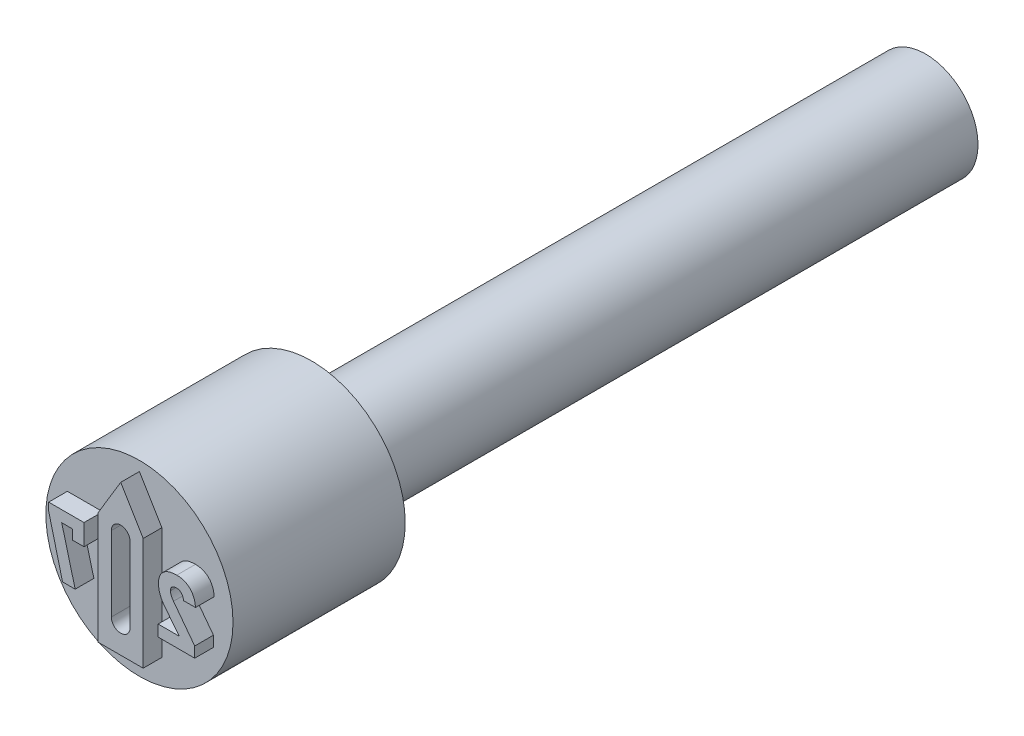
ISO-10303-21;
HEADER;
FILE_DESCRIPTION(('STEP AP214'),'2;1');
FILE_NAME('part.step','',(''),(''),'','','');
FILE_SCHEMA(('AUTOMOTIVE_DESIGN { 1 0 10303 214 1 1 1 1 }'));
ENDSEC;
DATA;
#1=APPLICATION_CONTEXT('core data for automotive mechanical design processes');
#2=APPLICATION_PROTOCOL_DEFINITION('international standard','automotive_design',2000,#1);
#3=PRODUCT_CONTEXT('',#1,'mechanical');
#4=PRODUCT('Part','Part','',(#3));
#5=PRODUCT_RELATED_PRODUCT_CATEGORY('part','',(#4));
#6=PRODUCT_DEFINITION_FORMATION('','',#4);
#7=PRODUCT_DEFINITION_CONTEXT('part definition',#1,'design');
#8=PRODUCT_DEFINITION('design','',#6,#7);
#9=PRODUCT_DEFINITION_SHAPE('','',#8);
#10=(LENGTH_UNIT() NAMED_UNIT(*) SI_UNIT(.MILLI.,.METRE.));
#11=(NAMED_UNIT(*) PLANE_ANGLE_UNIT() SI_UNIT($,.RADIAN.));
#12=(NAMED_UNIT(*) SI_UNIT($,.STERADIAN.) SOLID_ANGLE_UNIT());
#13=UNCERTAINTY_MEASURE_WITH_UNIT(LENGTH_MEASURE(1.E-05),#10,'distance_accuracy_value','');
#14=(GEOMETRIC_REPRESENTATION_CONTEXT(3) GLOBAL_UNCERTAINTY_ASSIGNED_CONTEXT((#13)) GLOBAL_UNIT_ASSIGNED_CONTEXT((#10,
#11,#12)) REPRESENTATION_CONTEXT('',''));
#15=CARTESIAN_POINT('',(0.,0.,0.));
#16=DIRECTION('',(0.,0.,1.));
#17=DIRECTION('',(1.,0.,0.));
#18=AXIS2_PLACEMENT_3D('',#15,#16,#17);
#19=CARTESIAN_POINT('',(0.,1.25,0.));
#20=DIRECTION('',(0.,0.,-1.));
#21=DIRECTION('',(-1.,0.,0.));
#22=AXIS2_PLACEMENT_3D('',#19,#20,#21);
#23=PLANE('',#22);
#24=DIRECTION('',(-1.,0.,0.));
#25=VECTOR('',#24,1.);
#26=CARTESIAN_POINT('',(-0.490027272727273,0.41,0.));
#27=LINE('',#26,#25);
#28=CARTESIAN_POINT('',(-0.490027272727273,0.41,0.));
#29=VERTEX_POINT('',#28);
#30=CARTESIAN_POINT('',(-0.962291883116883,0.41,0.));
#31=VERTEX_POINT('',#30);
#32=EDGE_CURVE('E342',#29,#31,#27,.T.);
#33=ORIENTED_EDGE('',*,*,#32,.F.);
#34=DIRECTION('',(0.,1.,0.));
#35=VECTOR('',#34,1.);
#36=CARTESIAN_POINT('',(-0.490027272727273,0.12974025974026,0.));
#37=LINE('',#36,#35);
#38=CARTESIAN_POINT('',(-0.490027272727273,0.12974025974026,0.));
#39=VERTEX_POINT('',#38);
#40=EDGE_CURVE('E347',#39,#29,#37,.T.);
#41=ORIENTED_EDGE('',*,*,#40,.F.);
#42=DIRECTION('',(1.,0.,0.));
#43=VECTOR('',#42,1.);
#44=CARTESIAN_POINT('',(-0.645820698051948,0.12974025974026,0.));
#45=LINE('',#44,#43);
#46=CARTESIAN_POINT('',(-0.645820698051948,0.12974025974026,0.));
#47=VERTEX_POINT('',#46);
#48=EDGE_CURVE('E384',#47,#39,#45,.T.);
#49=ORIENTED_EDGE('',*,*,#48,.F.);
#50=DIRECTION('',(0.,-1.,0.));
#51=VECTOR('',#50,1.);
#52=CARTESIAN_POINT('',(-0.645820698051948,0.259090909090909,0.));
#53=LINE('',#52,#51);
#54=CARTESIAN_POINT('',(-0.645820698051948,0.259090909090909,0.));
#55=VERTEX_POINT('',#54);
#56=EDGE_CURVE('E381',#55,#47,#53,.T.);
#57=ORIENTED_EDGE('',*,*,#56,.F.);
#58=DIRECTION('',(1.,0.,0.));
#59=VECTOR('',#58,1.);
#60=CARTESIAN_POINT('',(-0.787803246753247,0.259090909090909,0.));
#61=LINE('',#60,#59);
#62=CARTESIAN_POINT('',(-0.787803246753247,0.259090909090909,0.));
#63=VERTEX_POINT('',#62);
#64=EDGE_CURVE('E378',#63,#55,#61,.T.);
#65=ORIENTED_EDGE('',*,*,#64,.F.);
#66=DIRECTION('',(-0.255602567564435,0.966781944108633,0.));
#67=VECTOR('',#66,1.);
#68=CARTESIAN_POINT('',(-0.608261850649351,-0.42,0.));
#69=LINE('',#68,#67);
#70=CARTESIAN_POINT('',(-0.608261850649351,-0.42,0.));
#71=VERTEX_POINT('',#70);
#72=EDGE_CURVE('E375',#71,#63,#69,.T.);
#73=ORIENTED_EDGE('',*,*,#72,.F.);
#74=DIRECTION('',(1.,0.,0.));
#75=VECTOR('',#74,1.);
#76=CARTESIAN_POINT('',(-0.777024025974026,-0.42,0.));
#77=LINE('',#76,#75);
#78=CARTESIAN_POINT('',(-0.777024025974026,-0.42,0.));
#79=VERTEX_POINT('',#78);
#80=EDGE_CURVE('E372',#79,#71,#77,.T.);
#81=ORIENTED_EDGE('',*,*,#80,.F.);
#82=DIRECTION('',(0.247293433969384,-0.968940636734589,0.));
#83=VECTOR('',#82,1.);
#84=CARTESIAN_POINT('',(-0.962291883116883,0.305913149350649,0.));
#85=LINE('',#84,#83);
#86=CARTESIAN_POINT('',(-0.962291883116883,0.305913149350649,0.));
#87=VERTEX_POINT('',#86);
#88=EDGE_CURVE('E369',#87,#79,#85,.T.);
#89=ORIENTED_EDGE('',*,*,#88,.F.);
#90=DIRECTION('',(0.,-1.,0.));
#91=VECTOR('',#90,1.);
#92=CARTESIAN_POINT('',(-0.962291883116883,0.41,0.));
#93=LINE('',#92,#91);
#94=EDGE_CURVE('E366',#31,#87,#93,.T.);
#95=ORIENTED_EDGE('',*,*,#94,.F.);
#96=EDGE_LOOP('',(#33,#41,#49,#57,#65,#73,#81,#89,#95));
#97=FACE_BOUND('',#96,.T.);
#98=CARTESIAN_POINT('',(0.,0.,0.));
#99=DIRECTION('',(0.,0.,1.));
#100=DIRECTION('',(1.,0.,0.));
#101=AXIS2_PLACEMENT_3D('',#98,#99,#100);
#102=CIRCLE('',#101,1.25);
#103=CARTESIAN_POINT('',(1.25,0.,0.));
#104=VERTEX_POINT('',#103);
#105=EDGE_CURVE('E47',#104,#104,#102,.T.);
#106=ORIENTED_EDGE('',*,*,#105,.T.);
#107=EDGE_LOOP('',(#106));
#108=FACE_BOUND('',#107,.T.);
#109=DIRECTION('',(1.,0.,0.));
#110=VECTOR('',#109,1.);
#111=CARTESIAN_POINT('',(0.499754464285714,-0.42,0.));
#112=LINE('',#111,#110);
#113=CARTESIAN_POINT('',(0.499754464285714,-0.42,0.));
#114=VERTEX_POINT('',#113);
#115=CARTESIAN_POINT('',(0.988524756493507,-0.42,0.));
#116=VERTEX_POINT('',#115);
#117=EDGE_CURVE('E415',#114,#116,#112,.T.);
#118=ORIENTED_EDGE('',*,*,#117,.F.);
#119=DIRECTION('',(0.,-1.,0.));
#120=VECTOR('',#119,1.);
#121=CARTESIAN_POINT('',(0.499754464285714,-0.269090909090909,0.));
#122=LINE('',#121,#120);
#123=CARTESIAN_POINT('',(0.499754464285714,-0.269090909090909,0.));
#124=VERTEX_POINT('',#123);
#125=EDGE_CURVE('E420',#124,#114,#122,.T.);
#126=ORIENTED_EDGE('',*,*,#125,.F.);
#127=DIRECTION('',(-1.,0.,0.));
#128=VECTOR('',#127,1.);
#129=CARTESIAN_POINT('',(0.782203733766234,-0.269090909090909,0.));
#130=LINE('',#129,#128);
#131=CARTESIAN_POINT('',(0.782203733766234,-0.269090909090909,0.));
#132=VERTEX_POINT('',#131);
#133=EDGE_CURVE('E677',#132,#124,#130,.T.);
#134=ORIENTED_EDGE('',*,*,#133,.F.);
#135=DIRECTION('',(0.618183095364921,-0.786034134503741,0.));
#136=VECTOR('',#135,1.);
#137=CARTESIAN_POINT('',(0.578745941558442,-0.0103896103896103,0.));
#138=LINE('',#137,#136);
#139=CARTESIAN_POINT('',(0.578745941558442,-0.0103896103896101,0.));
#140=VERTEX_POINT('',#139);
#141=EDGE_CURVE('E671',#140,#132,#138,.T.);
#142=ORIENTED_EDGE('',*,*,#141,.F.);
#143=CARTESIAN_POINT('',(0.504301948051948,0.203173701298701,0.));
#144=CARTESIAN_POINT('',(0.504516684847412,0.193729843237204,0.));
#145=CARTESIAN_POINT('',(0.504946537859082,0.17482544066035,0.));
#146=CARTESIAN_POINT('',(0.508826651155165,0.146532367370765,0.));
#147=CARTESIAN_POINT('',(0.515079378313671,0.118383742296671,0.));
#148=CARTESIAN_POINT('',(0.523666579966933,0.0905155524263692,0.));
#149=CARTESIAN_POINT('',(0.534334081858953,0.0634105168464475,0.));
#150=CARTESIAN_POINT('',(0.547137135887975,0.0374398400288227,0.));
#151=CARTESIAN_POINT('',(0.561587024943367,0.0125920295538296,0.));
#152=CARTESIAN_POINT('',(0.573037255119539,-0.00274373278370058,0.));
#153=CARTESIAN_POINT('',(0.578745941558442,-0.0103896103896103,0.));
#154=B_SPLINE_CURVE_WITH_KNOTS('',3,(#143,#144,#145,#146,#147,#148,#149,#150,#151,#152,#153),
.UNSPECIFIED.,.F.,.F.,(4,1,1,1,1,1,1,1,4),(0.,0.123046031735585,0.246309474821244,
0.371480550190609,0.498560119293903,0.626024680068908,0.750715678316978,0.875715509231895,1.),.UNSPECIFIED.);
#155=CARTESIAN_POINT('',(0.504301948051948,0.203173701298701,0.));
#156=VERTEX_POINT('',#155);
#157=EDGE_CURVE('E666',#156,#140,#154,.T.);
#158=ORIENTED_EDGE('',*,*,#157,.F.);
#159=DIRECTION('',(0.,-1.,0.));
#160=VECTOR('',#159,1.);
#161=CARTESIAN_POINT('',(0.504301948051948,0.203847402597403,0.));
#162=LINE('',#161,#160);
#163=CARTESIAN_POINT('',(0.504301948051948,0.203847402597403,0.));
#164=VERTEX_POINT('',#163);
#165=EDGE_CURVE('E660',#164,#156,#162,.T.);
#166=ORIENTED_EDGE('',*,*,#165,.F.);
#167=CARTESIAN_POINT('',(0.748687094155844,0.420779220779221,0.));
#168=CARTESIAN_POINT('',(0.739247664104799,0.420645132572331,0.));
#169=CARTESIAN_POINT('',(0.720889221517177,0.420384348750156,0.));
#170=CARTESIAN_POINT('',(0.694162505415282,0.417569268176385,0.));
#171=CARTESIAN_POINT('',(0.669015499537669,0.413320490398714,0.));
#172=CARTESIAN_POINT('',(0.645488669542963,0.407104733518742,0.));
#173=CARTESIAN_POINT('',(0.62367646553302,0.398996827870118,0.));
#174=CARTESIAN_POINT('',(0.603513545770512,0.389220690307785,0.));
#175=CARTESIAN_POINT('',(0.584957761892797,0.377693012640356,0.));
#176=CARTESIAN_POINT('',(0.568151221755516,0.36438915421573,0.));
#177=CARTESIAN_POINT('',(0.553029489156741,0.34955082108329,0.));
#178=CARTESIAN_POINT('',(0.540013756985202,0.333027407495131,0.));
#179=CARTESIAN_POINT('',(0.528746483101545,0.315152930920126,0.));
#180=CARTESIAN_POINT('',(0.519938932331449,0.295580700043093,0.));
#181=CARTESIAN_POINT('',(0.512687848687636,0.274770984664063,0.));
#182=CARTESIAN_POINT('',(0.507992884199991,0.252350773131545,0.));
#183=CARTESIAN_POINT('',(0.504829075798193,0.22858403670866,0.));
#184=CARTESIAN_POINT('',(0.504480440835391,0.212223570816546,0.));
#185=CARTESIAN_POINT('',(0.504301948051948,0.203847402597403,0.));
#186=B_SPLINE_CURVE_WITH_KNOTS('',3,(#167,#168,#169,#170,#171,#172,#173,#174,#175,#176,#177,
#178,#179,#180,#181,#182,#183,#184,#185),.UNSPECIFIED.,.F.,.F.,(4,1,1,1,1,1,1,1,1,1,1,1,1,1,1,1,
4),(0.,0.0762312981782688,0.148259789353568,0.216860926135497,0.28210063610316,
0.344528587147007,0.404571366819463,0.462840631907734,0.520642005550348,0.577409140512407,
0.633580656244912,0.690215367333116,0.747647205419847,0.806597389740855,0.867894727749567,
0.932365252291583,1.),.UNSPECIFIED.);
#187=CARTESIAN_POINT('',(0.748687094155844,0.420779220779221,0.));
#188=VERTEX_POINT('',#187);
#189=EDGE_CURVE('E652',#188,#164,#186,.T.);
#190=ORIENTED_EDGE('',*,*,#189,.F.);
#191=CARTESIAN_POINT('',(0.998798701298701,0.171678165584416,0.));
#192=CARTESIAN_POINT('',(0.998010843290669,0.181299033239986,0.));
#193=CARTESIAN_POINT('',(0.996472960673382,0.200078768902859,0.));
#194=CARTESIAN_POINT('',(0.991431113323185,0.227244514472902,0.));
#195=CARTESIAN_POINT('',(0.984914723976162,0.252832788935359,0.));
#196=CARTESIAN_POINT('',(0.976624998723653,0.276838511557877,0.));
#197=CARTESIAN_POINT('',(0.96597267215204,0.298983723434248,0.));
#198=CARTESIAN_POINT('',(0.954004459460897,0.31973136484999,0.));
#199=CARTESIAN_POINT('',(0.939609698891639,0.338439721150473,0.));
#200=CARTESIAN_POINT('',(0.923852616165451,0.355734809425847,0.));
#201=CARTESIAN_POINT('',(0.9063020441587,0.370968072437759,0.));
#202=CARTESIAN_POINT('',(0.887588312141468,0.384405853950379,0.));
#203=CARTESIAN_POINT('',(0.86742843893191,0.395588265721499,0.));
#204=CARTESIAN_POINT('',(0.846128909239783,0.404864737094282,0.));
#205=CARTESIAN_POINT('',(0.823453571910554,0.411905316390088,0.));
#206=CARTESIAN_POINT('',(0.799698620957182,0.417179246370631,0.));
#207=CARTESIAN_POINT('',(0.774591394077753,0.420220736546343,0.));
#208=CARTESIAN_POINT('',(0.757453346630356,0.420590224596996,0.));
#209=CARTESIAN_POINT('',(0.748687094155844,0.420779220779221,0.));
#210=B_SPLINE_CURVE_WITH_KNOTS('',3,(#191,#192,#193,#194,#195,#196,#197,#198,#199,#200,#201,
#202,#203,#204,#205,#206,#207,#208,#209),.UNSPECIFIED.,.F.,.F.,(4,1,1,1,1,1,1,1,1,1,1,1,1,1,1,1,
4),(0.,0.073326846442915,0.143132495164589,0.209679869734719,0.273918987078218,0.33576228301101,
0.396210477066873,0.45560885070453,0.514796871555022,0.573764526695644,0.631900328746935,
0.689592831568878,0.748648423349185,0.808163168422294,0.86976604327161,0.933384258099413,1.),.UNSPECIFIED.);
#211=CARTESIAN_POINT('',(0.998798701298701,0.171678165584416,0.));
#212=VERTEX_POINT('',#211);
#213=EDGE_CURVE('E647',#212,#188,#210,.T.);
#214=ORIENTED_EDGE('',*,*,#213,.F.);
#215=DIRECTION('',(0.,1.,0.));
#216=VECTOR('',#215,1.);
#217=CARTESIAN_POINT('',(0.998798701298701,0.17117288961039,0.));
#218=LINE('',#217,#216);
#219=CARTESIAN_POINT('',(0.998798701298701,0.17117288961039,0.));
#220=VERTEX_POINT('',#219);
#221=EDGE_CURVE('E644',#220,#212,#218,.T.);
#222=ORIENTED_EDGE('',*,*,#221,.F.);
#223=DIRECTION('',(1.,0.,0.));
#224=VECTOR('',#223,1.);
#225=CARTESIAN_POINT('',(0.839131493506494,0.17117288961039,0.));
#226=LINE('',#225,#224);
#227=CARTESIAN_POINT('',(0.839131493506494,0.17117288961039,0.));
#228=VERTEX_POINT('',#227);
#229=EDGE_CURVE('E641',#228,#220,#226,.T.);
#230=ORIENTED_EDGE('',*,*,#229,.F.);
#231=DIRECTION('',(0.,-1.,0.));
#232=VECTOR('',#231,1.);
#233=CARTESIAN_POINT('',(0.839131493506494,0.171678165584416,0.));
#234=LINE('',#233,#232);
#235=CARTESIAN_POINT('',(0.839131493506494,0.171678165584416,0.));
#236=VERTEX_POINT('',#235);
#237=EDGE_CURVE('E635',#236,#228,#234,.T.);
#238=ORIENTED_EDGE('',*,*,#237,.F.);
#239=CARTESIAN_POINT('',(0.747508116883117,0.26987012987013,0.));
#240=CARTESIAN_POINT('',(0.753609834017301,0.269632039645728,0.));
#241=CARTESIAN_POINT('',(0.765465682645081,0.269169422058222,0.));
#242=CARTESIAN_POINT('',(0.782249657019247,0.264042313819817,0.));
#243=CARTESIAN_POINT('',(0.797373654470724,0.25600007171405,0.));
#244=CARTESIAN_POINT('',(0.810411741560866,0.244524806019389,0.));
#245=CARTESIAN_POINT('',(0.821208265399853,0.230117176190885,0.));
#246=CARTESIAN_POINT('',(0.829970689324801,0.213151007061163,0.));
#247=CARTESIAN_POINT('',(0.835922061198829,0.193319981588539,0.));
#248=CARTESIAN_POINT('',(0.838027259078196,0.179124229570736,0.));
#249=CARTESIAN_POINT('',(0.839131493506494,0.171678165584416,0.));
#250=B_SPLINE_CURVE_WITH_KNOTS('',3,(#239,#240,#241,#242,#243,#244,#245,#246,#247,#248,#249),
.UNSPECIFIED.,.F.,.F.,(4,1,1,1,1,1,1,1,4),(0.,0.122603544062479,0.238222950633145,
0.350089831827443,0.465559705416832,0.585028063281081,0.711014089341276,0.848418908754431,1.),.UNSPECIFIED.);
#251=CARTESIAN_POINT('',(0.747508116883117,0.26987012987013,0.));
#252=VERTEX_POINT('',#251);
#253=EDGE_CURVE('E627',#252,#236,#250,.T.);
#254=ORIENTED_EDGE('',*,*,#253,.F.);
#255=CARTESIAN_POINT('',(0.664642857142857,0.199468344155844,0.));
#256=CARTESIAN_POINT('',(0.664872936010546,0.204775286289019,0.));
#257=CARTESIAN_POINT('',(0.665313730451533,0.214942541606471,0.));
#258=CARTESIAN_POINT('',(0.669466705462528,0.229268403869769,0.));
#259=CARTESIAN_POINT('',(0.676273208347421,0.241744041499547,0.));
#260=CARTESIAN_POINT('',(0.686021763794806,0.252048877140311,0.));
#261=CARTESIAN_POINT('',(0.698157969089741,0.26019938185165,0.));
#262=CARTESIAN_POINT('',(0.712679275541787,0.265943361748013,0.));
#263=CARTESIAN_POINT('',(0.729395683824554,0.269237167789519,0.));
#264=CARTESIAN_POINT('',(0.74126093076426,0.269651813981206,0.));
#265=CARTESIAN_POINT('',(0.747508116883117,0.26987012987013,0.));
#266=B_SPLINE_CURVE_WITH_KNOTS('',3,(#255,#256,#257,#258,#259,#260,#261,#262,#263,#264,#265),
.UNSPECIFIED.,.F.,.F.,(4,1,1,1,1,1,1,1,4),(0.,0.128749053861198,0.246662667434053,
0.359069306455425,0.471077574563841,0.588039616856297,0.711712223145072,0.848213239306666,1.),.UNSPECIFIED.);
#267=CARTESIAN_POINT('',(0.664642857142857,0.199468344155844,0.));
#268=VERTEX_POINT('',#267);
#269=EDGE_CURVE('E622',#268,#252,#266,.T.);
#270=ORIENTED_EDGE('',*,*,#269,.F.);
#271=DIRECTION('',(0.,1.,0.));
#272=VECTOR('',#271,1.);
#273=CARTESIAN_POINT('',(0.664642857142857,0.198289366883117,0.));
#274=LINE('',#273,#272);
#275=CARTESIAN_POINT('',(0.664642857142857,0.198289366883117,0.));
#276=VERTEX_POINT('',#275);
#277=EDGE_CURVE('E616',#276,#268,#274,.T.);
#278=ORIENTED_EDGE('',*,*,#277,.F.);
#279=CARTESIAN_POINT('',(0.70489650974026,0.0968973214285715,0.));
#280=CARTESIAN_POINT('',(0.698955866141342,0.10526800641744,0.));
#281=CARTESIAN_POINT('',(0.687380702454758,0.121578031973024,0.));
#282=CARTESIAN_POINT('',(0.676904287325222,0.143976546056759,0.));
#283=CARTESIAN_POINT('',(0.670377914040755,0.161537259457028,0.));
#284=CARTESIAN_POINT('',(0.667267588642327,0.174272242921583,0.));
#285=CARTESIAN_POINT('',(0.665048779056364,0.186422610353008,0.));
#286=CARTESIAN_POINT('',(0.664775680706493,0.194406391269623,0.));
#287=CARTESIAN_POINT('',(0.664642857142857,0.198289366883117,0.));
#288=B_SPLINE_CURVE_WITH_KNOTS('',3,(#279,#280,#281,#282,#283,#284,#285,#286,#287),
.UNSPECIFIED.,.F.,.F.,(4,1,1,1,1,1,4),(0.,0.27737542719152,0.54045759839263,0.666416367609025,
0.784009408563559,0.894951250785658,1.),.UNSPECIFIED.);
#289=CARTESIAN_POINT('',(0.70489650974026,0.0968973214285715,0.));
#290=VERTEX_POINT('',#289);
#291=EDGE_CURVE('E611',#290,#276,#288,.T.);
#292=ORIENTED_EDGE('',*,*,#291,.F.);
#293=DIRECTION('',(-0.602458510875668,0.798150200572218,0.));
#294=VECTOR('',#293,1.);
#295=CARTESIAN_POINT('',(0.988524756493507,-0.278859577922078,0.));
#296=LINE('',#295,#294);
#297=CARTESIAN_POINT('',(0.988524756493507,-0.278859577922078,0.));
#298=VERTEX_POINT('',#297);
#299=EDGE_CURVE('E608',#298,#290,#296,.T.);
#300=ORIENTED_EDGE('',*,*,#299,.F.);
#301=DIRECTION('',(0.,1.,0.));
#302=VECTOR('',#301,1.);
#303=CARTESIAN_POINT('',(0.988524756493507,-0.42,0.));
#304=LINE('',#303,#302);
#305=EDGE_CURVE('E605',#116,#298,#304,.T.);
#306=ORIENTED_EDGE('',*,*,#305,.F.);
#307=EDGE_LOOP('',(#118,#126,#134,#142,#158,#166,#190,#214,#222,#230,#238,#254,#270,#278,#292,
#300,#306));
#308=FACE_BOUND('',#307,.T.);
#309=DIRECTION('',(0.,1.,0.));
#310=VECTOR('',#309,1.);
#311=CARTESIAN_POINT('',(0.3,-0.88,0.));
#312=LINE('',#311,#310);
#313=CARTESIAN_POINT('',(0.3,-0.88,0.));
#314=VERTEX_POINT('',#313);
#315=CARTESIAN_POINT('',(0.3,0.62,0.));
#316=VERTEX_POINT('',#315);
#317=EDGE_CURVE('E301',#314,#316,#312,.T.);
#318=ORIENTED_EDGE('',*,*,#317,.F.);
#319=DIRECTION('',(1.,0.,0.));
#320=VECTOR('',#319,1.);
#321=CARTESIAN_POINT('',(-0.3,-0.88,0.));
#322=LINE('',#321,#320);
#323=CARTESIAN_POINT('',(-0.3,-0.88,0.));
#324=VERTEX_POINT('',#323);
#325=EDGE_CURVE('E309',#324,#314,#322,.T.);
#326=ORIENTED_EDGE('',*,*,#325,.F.);
#327=DIRECTION('',(0.,-1.,0.));
#328=VECTOR('',#327,1.);
#329=CARTESIAN_POINT('',(-0.3,0.621430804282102,0.));
#330=LINE('',#329,#328);
#331=CARTESIAN_POINT('',(-0.3,0.621430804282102,0.));
#332=VERTEX_POINT('',#331);
#333=EDGE_CURVE('E324',#332,#324,#330,.T.);
#334=ORIENTED_EDGE('',*,*,#333,.F.);
#335=DIRECTION('',(-0.515580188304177,-0.856841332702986,0.));
#336=VECTOR('',#335,1.);
#337=CARTESIAN_POINT('',(0.,1.12,0.));
#338=LINE('',#337,#336);
#339=CARTESIAN_POINT('',(0.,1.12,0.));
#340=VERTEX_POINT('',#339);
#341=EDGE_CURVE('E321',#340,#332,#338,.T.);
#342=ORIENTED_EDGE('',*,*,#341,.F.);
#343=DIRECTION('',(-0.514495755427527,0.857492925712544,0.));
#344=VECTOR('',#343,1.);
#345=CARTESIAN_POINT('',(0.3,0.62,0.));
#346=LINE('',#345,#344);
#347=EDGE_CURVE('E62',#316,#340,#346,.T.);
#348=ORIENTED_EDGE('',*,*,#347,.F.);
#349=EDGE_LOOP('',(#318,#326,#334,#342,#348));
#350=FACE_BOUND('',#349,.T.);
#351=ADVANCED_FACE('F39',(#97,#108,#308,#350),#23,.F.);
#352=CARTESIAN_POINT('',(0.,0.7,-2.3));
#353=DIRECTION('',(0.,0.,1.));
#354=DIRECTION('',(1.,0.,0.));
#355=AXIS2_PLACEMENT_3D('',#352,#353,#354);
#356=PLANE('',#355);
#357=CARTESIAN_POINT('',(0.,0.,-2.3));
#358=DIRECTION('',(0.,0.,1.));
#359=DIRECTION('',(1.,0.,0.));
#360=AXIS2_PLACEMENT_3D('',#357,#358,#359);
#361=CIRCLE('',#360,1.25);
#362=CARTESIAN_POINT('',(1.25,0.,-2.3));
#363=VERTEX_POINT('',#362);
#364=EDGE_CURVE('E11',#363,#363,#361,.T.);
#365=ORIENTED_EDGE('',*,*,#364,.F.);
#366=EDGE_LOOP('',(#365));
#367=FACE_BOUND('',#366,.T.);
#368=CARTESIAN_POINT('',(0.,0.,-2.3));
#369=DIRECTION('',(0.,0.,1.));
#370=DIRECTION('',(1.,0.,0.));
#371=AXIS2_PLACEMENT_3D('',#368,#369,#370);
#372=CIRCLE('',#371,0.7);
#373=CARTESIAN_POINT('',(0.7,0.,-2.3));
#374=VERTEX_POINT('',#373);
#375=EDGE_CURVE('E478',#374,#374,#372,.T.);
#376=ORIENTED_EDGE('',*,*,#375,.T.);
#377=EDGE_LOOP('',(#376));
#378=FACE_BOUND('',#377,.T.);
#379=ADVANCED_FACE('F41',(#367,#378),#356,.F.);
#380=CARTESIAN_POINT('',(0.,0.,-0.403888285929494));
#381=DIRECTION('',(0.,0.,1.));
#382=DIRECTION('',(1.,0.,0.));
#383=AXIS2_PLACEMENT_3D('',#380,#381,#382);
#384=CYLINDRICAL_SURFACE('',#383,1.25);
#385=ORIENTED_EDGE('',*,*,#105,.F.);
#386=EDGE_LOOP('',(#385));
#387=FACE_BOUND('',#386,.T.);
#388=ORIENTED_EDGE('',*,*,#364,.T.);
#389=EDGE_LOOP('',(#388));
#390=FACE_BOUND('',#389,.T.);
#391=ADVANCED_FACE('F461',(#387,#390),#384,.T.);
#392=CARTESIAN_POINT('',(0.,0.,-10.5));
#393=DIRECTION('',(0.,0.,1.));
#394=DIRECTION('',(1.,0.,0.));
#395=AXIS2_PLACEMENT_3D('',#392,#393,#394);
#396=PLANE('',#395);
#397=CARTESIAN_POINT('',(0.,0.,-10.5));
#398=DIRECTION('',(0.,0.,1.));
#399=DIRECTION('',(1.,0.,0.));
#400=AXIS2_PLACEMENT_3D('',#397,#398,#399);
#401=CIRCLE('',#400,0.700000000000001);
#402=CARTESIAN_POINT('',(0.700000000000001,0.,-10.5));
#403=VERTEX_POINT('',#402);
#404=EDGE_CURVE('E479',#403,#403,#401,.T.);
#405=ORIENTED_EDGE('',*,*,#404,.F.);
#406=EDGE_LOOP('',(#405));
#407=FACE_BOUND('',#406,.T.);
#408=ADVANCED_FACE('F457',(#407),#396,.F.);
#409=CARTESIAN_POINT('',(0.,0.,-0.403888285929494));
#410=DIRECTION('',(0.,0.,1.));
#411=DIRECTION('',(1.,0.,0.));
#412=AXIS2_PLACEMENT_3D('',#409,#410,#411);
#413=CYLINDRICAL_SURFACE('',#412,0.7);
#414=ORIENTED_EDGE('',*,*,#375,.F.);
#415=EDGE_LOOP('',(#414));
#416=FACE_BOUND('',#415,.T.);
#417=ORIENTED_EDGE('',*,*,#404,.T.);
#418=EDGE_LOOP('',(#417));
#419=FACE_BOUND('',#418,.T.);
#420=ADVANCED_FACE('F453',(#416,#419),#413,.T.);
#421=CARTESIAN_POINT('',(0.499754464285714,-0.42,0.25));
#422=DIRECTION('',(0.,1.,0.));
#423=DIRECTION('',(0.,0.,1.));
#424=AXIS2_PLACEMENT_3D('',#421,#422,#423);
#425=PLANE('',#424);
#426=ORIENTED_EDGE('',*,*,#117,.T.);
#427=DIRECTION('',(0.,0.,-1.));
#428=VECTOR('',#427,1.);
#429=CARTESIAN_POINT('',(0.988524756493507,-0.42,0.25));
#430=LINE('',#429,#428);
#431=CARTESIAN_POINT('',(0.988524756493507,-0.42,0.25));
#432=VERTEX_POINT('',#431);
#433=EDGE_CURVE('E480',#432,#116,#430,.T.);
#434=ORIENTED_EDGE('',*,*,#433,.F.);
#435=DIRECTION('',(1.,0.,0.));
#436=VECTOR('',#435,1.);
#437=CARTESIAN_POINT('',(0.499754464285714,-0.42,0.25));
#438=LINE('',#437,#436);
#439=CARTESIAN_POINT('',(0.499754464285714,-0.42,0.25));
#440=VERTEX_POINT('',#439);
#441=EDGE_CURVE('E416',#440,#432,#438,.T.);
#442=ORIENTED_EDGE('',*,*,#441,.F.);
#443=DIRECTION('',(0.,0.,-1.));
#444=VECTOR('',#443,1.);
#445=CARTESIAN_POINT('',(0.499754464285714,-0.42,0.25));
#446=LINE('',#445,#444);
#447=EDGE_CURVE('E603',#440,#114,#446,.T.);
#448=ORIENTED_EDGE('',*,*,#447,.T.);
#449=EDGE_LOOP('',(#426,#434,#442,#448));
#450=FACE_BOUND('',#449,.T.);
#451=ADVANCED_FACE('F449',(#450),#425,.F.);
#452=CARTESIAN_POINT('',(0.988524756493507,-0.42,0.25));
#453=DIRECTION('',(-1.,0.,0.));
#454=DIRECTION('',(0.,0.,1.));
#455=AXIS2_PLACEMENT_3D('',#452,#453,#454);
#456=PLANE('',#455);
#457=ORIENTED_EDGE('',*,*,#305,.T.);
#458=DIRECTION('',(0.,0.,-1.));
#459=VECTOR('',#458,1.);
#460=CARTESIAN_POINT('',(0.988524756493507,-0.278859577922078,0.25));
#461=LINE('',#460,#459);
#462=CARTESIAN_POINT('',(0.988524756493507,-0.278859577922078,0.25));
#463=VERTEX_POINT('',#462);
#464=EDGE_CURVE('E485',#463,#298,#461,.T.);
#465=ORIENTED_EDGE('',*,*,#464,.F.);
#466=DIRECTION('',(0.,1.,0.));
#467=VECTOR('',#466,1.);
#468=CARTESIAN_POINT('',(0.988524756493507,-0.42,0.25));
#469=LINE('',#468,#467);
#470=EDGE_CURVE('E419',#432,#463,#469,.T.);
#471=ORIENTED_EDGE('',*,*,#470,.F.);
#472=ORIENTED_EDGE('',*,*,#433,.T.);
#473=EDGE_LOOP('',(#457,#465,#471,#472));
#474=FACE_BOUND('',#473,.T.);
#475=ADVANCED_FACE('F445',(#474),#456,.F.);
#476=CARTESIAN_POINT('',(0.988524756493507,-0.278859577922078,0.25));
#477=DIRECTION('',(-0.798150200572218,-0.602458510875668,0.));
#478=DIRECTION('',(0.602458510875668,-0.798150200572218,0.));
#479=AXIS2_PLACEMENT_3D('',#476,#477,#478);
#480=PLANE('',#479);
#481=ORIENTED_EDGE('',*,*,#299,.T.);
#482=DIRECTION('',(0.,0.,-1.));
#483=VECTOR('',#482,1.);
#484=CARTESIAN_POINT('',(0.70489650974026,0.0968973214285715,0.25));
#485=LINE('',#484,#483);
#486=CARTESIAN_POINT('',(0.70489650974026,0.0968973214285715,0.25));
#487=VERTEX_POINT('',#486);
#488=EDGE_CURVE('E722',#487,#290,#485,.T.);
#489=ORIENTED_EDGE('',*,*,#488,.F.);
#490=DIRECTION('',(-0.602458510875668,0.798150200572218,0.));
#491=VECTOR('',#490,1.);
#492=CARTESIAN_POINT('',(0.988524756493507,-0.278859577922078,0.25));
#493=LINE('',#492,#491);
#494=EDGE_CURVE('E422',#463,#487,#493,.T.);
#495=ORIENTED_EDGE('',*,*,#494,.F.);
#496=ORIENTED_EDGE('',*,*,#464,.T.);
#497=EDGE_LOOP('',(#481,#489,#495,#496));
#498=FACE_BOUND('',#497,.T.);
#499=ADVANCED_FACE('F440',(#498),#480,.F.);
#500=CARTESIAN_POINT('',(0.70489650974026,0.0968973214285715,0.25));
#501=CARTESIAN_POINT('',(0.698955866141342,0.10526800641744,0.25));
#502=CARTESIAN_POINT('',(0.687380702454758,0.121578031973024,0.25));
#503=CARTESIAN_POINT('',(0.676904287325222,0.143976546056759,0.25));
#504=CARTESIAN_POINT('',(0.670377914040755,0.161537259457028,0.25));
#505=CARTESIAN_POINT('',(0.667267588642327,0.174272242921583,0.25));
#506=CARTESIAN_POINT('',(0.665048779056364,0.186422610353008,0.25));
#507=CARTESIAN_POINT('',(0.664775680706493,0.194406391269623,0.25));
#508=CARTESIAN_POINT('',(0.664642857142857,0.198289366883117,0.25));
#509=B_SPLINE_CURVE_WITH_KNOTS('',3,(#500,#501,#502,#503,#504,#505,#506,#507,#508),
.UNSPECIFIED.,.F.,.F.,(4,1,1,1,1,1,4),(0.,0.27737542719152,0.54045759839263,0.666416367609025,
0.784009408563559,0.894951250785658,1.),.UNSPECIFIED.);
#510=DIRECTION('',(0.,0.,-1.));
#511=VECTOR('',#510,1.);
#512=SURFACE_OF_LINEAR_EXTRUSION('',#509,#511);
#513=ORIENTED_EDGE('',*,*,#291,.T.);
#514=DIRECTION('',(0.,0.,-1.));
#515=VECTOR('',#514,1.);
#516=CARTESIAN_POINT('',(0.664642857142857,0.198289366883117,0.25));
#517=LINE('',#516,#515);
#518=CARTESIAN_POINT('',(0.664642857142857,0.198289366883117,0.25));
#519=VERTEX_POINT('',#518);
#520=EDGE_CURVE('E719',#519,#276,#517,.T.);
#521=ORIENTED_EDGE('',*,*,#520,.F.);
#522=EDGE_CURVE('E424',#487,#519,#509,.T.);
#523=ORIENTED_EDGE('',*,*,#522,.F.);
#524=ORIENTED_EDGE('',*,*,#488,.T.);
#525=EDGE_LOOP('',(#513,#521,#523,#524));
#526=FACE_BOUND('',#525,.T.);
#527=ADVANCED_FACE('F435',(#526),#512,.F.);
#528=CARTESIAN_POINT('',(0.664642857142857,0.198289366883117,0.25));
#529=DIRECTION('',(-1.,0.,0.));
#530=DIRECTION('',(0.,0.,1.));
#531=AXIS2_PLACEMENT_3D('',#528,#529,#530);
#532=PLANE('',#531);
#533=ORIENTED_EDGE('',*,*,#277,.T.);
#534=DIRECTION('',(0.,0.,-1.));
#535=VECTOR('',#534,1.);
#536=CARTESIAN_POINT('',(0.664642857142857,0.199468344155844,0.25));
#537=LINE('',#536,#535);
#538=CARTESIAN_POINT('',(0.664642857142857,0.199468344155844,0.25));
#539=VERTEX_POINT('',#538);
#540=EDGE_CURVE('E716',#539,#268,#537,.T.);
#541=ORIENTED_EDGE('',*,*,#540,.F.);
#542=DIRECTION('',(0.,1.,0.));
#543=VECTOR('',#542,1.);
#544=CARTESIAN_POINT('',(0.664642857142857,0.198289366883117,0.25));
#545=LINE('',#544,#543);
#546=EDGE_CURVE('E429',#519,#539,#545,.T.);
#547=ORIENTED_EDGE('',*,*,#546,.F.);
#548=ORIENTED_EDGE('',*,*,#520,.T.);
#549=EDGE_LOOP('',(#533,#541,#547,#548));
#550=FACE_BOUND('',#549,.T.);
#551=ADVANCED_FACE('F439',(#550),#532,.F.);
#552=CARTESIAN_POINT('',(0.664642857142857,0.199468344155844,0.25));
#553=CARTESIAN_POINT('',(0.664872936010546,0.204775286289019,0.25));
#554=CARTESIAN_POINT('',(0.665313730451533,0.214942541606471,0.25));
#555=CARTESIAN_POINT('',(0.669466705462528,0.229268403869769,0.25));
#556=CARTESIAN_POINT('',(0.676273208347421,0.241744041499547,0.25));
#557=CARTESIAN_POINT('',(0.686021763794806,0.252048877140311,0.25));
#558=CARTESIAN_POINT('',(0.698157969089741,0.26019938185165,0.25));
#559=CARTESIAN_POINT('',(0.712679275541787,0.265943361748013,0.25));
#560=CARTESIAN_POINT('',(0.729395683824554,0.269237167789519,0.25));
#561=CARTESIAN_POINT('',(0.74126093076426,0.269651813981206,0.25));
#562=CARTESIAN_POINT('',(0.747508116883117,0.26987012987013,0.25));
#563=B_SPLINE_CURVE_WITH_KNOTS('',3,(#552,#553,#554,#555,#556,#557,#558,#559,#560,#561,#562),
.UNSPECIFIED.,.F.,.F.,(4,1,1,1,1,1,1,1,4),(0.,0.128749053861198,0.246662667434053,
0.359069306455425,0.471077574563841,0.588039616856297,0.711712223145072,0.848213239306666,1.),.UNSPECIFIED.);
#564=DIRECTION('',(0.,0.,-1.));
#565=VECTOR('',#564,1.);
#566=SURFACE_OF_LINEAR_EXTRUSION('',#563,#565);
#567=ORIENTED_EDGE('',*,*,#269,.T.);
#568=DIRECTION('',(0.,0.,-1.));
#569=VECTOR('',#568,1.);
#570=CARTESIAN_POINT('',(0.747508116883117,0.26987012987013,0.25));
#571=LINE('',#570,#569);
#572=CARTESIAN_POINT('',(0.747508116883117,0.26987012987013,0.25));
#573=VERTEX_POINT('',#572);
#574=EDGE_CURVE('E713',#573,#252,#571,.T.);
#575=ORIENTED_EDGE('',*,*,#574,.F.);
#576=EDGE_CURVE('E735',#539,#573,#563,.T.);
#577=ORIENTED_EDGE('',*,*,#576,.F.);
#578=ORIENTED_EDGE('',*,*,#540,.T.);
#579=EDGE_LOOP('',(#567,#575,#577,#578));
#580=FACE_BOUND('',#579,.T.);
#581=ADVANCED_FACE('F750',(#580),#566,.F.);
#582=CARTESIAN_POINT('',(0.747508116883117,0.26987012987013,0.25));
#583=CARTESIAN_POINT('',(0.753609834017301,0.269632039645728,0.25));
#584=CARTESIAN_POINT('',(0.765465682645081,0.269169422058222,0.25));
#585=CARTESIAN_POINT('',(0.782249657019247,0.264042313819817,0.25));
#586=CARTESIAN_POINT('',(0.797373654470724,0.25600007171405,0.25));
#587=CARTESIAN_POINT('',(0.810411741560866,0.244524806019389,0.25));
#588=CARTESIAN_POINT('',(0.821208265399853,0.230117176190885,0.25));
#589=CARTESIAN_POINT('',(0.829970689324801,0.213151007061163,0.25));
#590=CARTESIAN_POINT('',(0.835922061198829,0.193319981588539,0.25));
#591=CARTESIAN_POINT('',(0.838027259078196,0.179124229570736,0.25));
#592=CARTESIAN_POINT('',(0.839131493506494,0.171678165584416,0.25));
#593=B_SPLINE_CURVE_WITH_KNOTS('',3,(#582,#583,#584,#585,#586,#587,#588,#589,#590,#591,#592),
.UNSPECIFIED.,.F.,.F.,(4,1,1,1,1,1,1,1,4),(0.,0.122603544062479,0.238222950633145,
0.350089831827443,0.465559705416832,0.585028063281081,0.711014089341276,0.848418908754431,1.),.UNSPECIFIED.);
#594=DIRECTION('',(0.,0.,-1.));
#595=VECTOR('',#594,1.);
#596=SURFACE_OF_LINEAR_EXTRUSION('',#593,#595);
#597=ORIENTED_EDGE('',*,*,#253,.T.);
#598=DIRECTION('',(0.,0.,-1.));
#599=VECTOR('',#598,1.);
#600=CARTESIAN_POINT('',(0.839131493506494,0.171678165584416,0.25));
#601=LINE('',#600,#599);
#602=CARTESIAN_POINT('',(0.839131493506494,0.171678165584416,0.25));
#603=VERTEX_POINT('',#602);
#604=EDGE_CURVE('E710',#603,#236,#601,.T.);
#605=ORIENTED_EDGE('',*,*,#604,.F.);
#606=EDGE_CURVE('E736',#573,#603,#593,.T.);
#607=ORIENTED_EDGE('',*,*,#606,.F.);
#608=ORIENTED_EDGE('',*,*,#574,.T.);
#609=EDGE_LOOP('',(#597,#605,#607,#608));
#610=FACE_BOUND('',#609,.T.);
#611=ADVANCED_FACE('F753',(#610),#596,.F.);
#612=CARTESIAN_POINT('',(0.839131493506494,0.171678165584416,0.25));
#613=DIRECTION('',(1.,0.,0.));
#614=DIRECTION('',(0.,0.,-1.));
#615=AXIS2_PLACEMENT_3D('',#612,#613,#614);
#616=PLANE('',#615);
#617=ORIENTED_EDGE('',*,*,#237,.T.);
#618=DIRECTION('',(0.,0.,-1.));
#619=VECTOR('',#618,1.);
#620=CARTESIAN_POINT('',(0.839131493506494,0.17117288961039,0.25));
#621=LINE('',#620,#619);
#622=CARTESIAN_POINT('',(0.839131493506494,0.17117288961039,0.25));
#623=VERTEX_POINT('',#622);
#624=EDGE_CURVE('E707',#623,#228,#621,.T.);
#625=ORIENTED_EDGE('',*,*,#624,.F.);
#626=DIRECTION('',(0.,-1.,0.));
#627=VECTOR('',#626,1.);
#628=CARTESIAN_POINT('',(0.839131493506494,0.171678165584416,0.25));
#629=LINE('',#628,#627);
#630=EDGE_CURVE('E738',#603,#623,#629,.T.);
#631=ORIENTED_EDGE('',*,*,#630,.F.);
#632=ORIENTED_EDGE('',*,*,#604,.T.);
#633=EDGE_LOOP('',(#617,#625,#631,#632));
#634=FACE_BOUND('',#633,.T.);
#635=ADVANCED_FACE('F757',(#634),#616,.F.);
#636=CARTESIAN_POINT('',(0.839131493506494,0.17117288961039,0.25));
#637=DIRECTION('',(0.,1.,0.));
#638=DIRECTION('',(0.,0.,1.));
#639=AXIS2_PLACEMENT_3D('',#636,#637,#638);
#640=PLANE('',#639);
#641=ORIENTED_EDGE('',*,*,#229,.T.);
#642=DIRECTION('',(0.,0.,-1.));
#643=VECTOR('',#642,1.);
#644=CARTESIAN_POINT('',(0.998798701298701,0.17117288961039,0.25));
#645=LINE('',#644,#643);
#646=CARTESIAN_POINT('',(0.998798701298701,0.17117288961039,0.25));
#647=VERTEX_POINT('',#646);
#648=EDGE_CURVE('E704',#647,#220,#645,.T.);
#649=ORIENTED_EDGE('',*,*,#648,.F.);
#650=DIRECTION('',(1.,0.,0.));
#651=VECTOR('',#650,1.);
#652=CARTESIAN_POINT('',(0.839131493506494,0.17117288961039,0.25));
#653=LINE('',#652,#651);
#654=EDGE_CURVE('E813',#623,#647,#653,.T.);
#655=ORIENTED_EDGE('',*,*,#654,.F.);
#656=ORIENTED_EDGE('',*,*,#624,.T.);
#657=EDGE_LOOP('',(#641,#649,#655,#656));
#658=FACE_BOUND('',#657,.T.);
#659=ADVANCED_FACE('F761',(#658),#640,.F.);
#660=CARTESIAN_POINT('',(0.998798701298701,0.17117288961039,0.25));
#661=DIRECTION('',(-1.,0.,0.));
#662=DIRECTION('',(0.,0.,1.));
#663=AXIS2_PLACEMENT_3D('',#660,#661,#662);
#664=PLANE('',#663);
#665=ORIENTED_EDGE('',*,*,#221,.T.);
#666=DIRECTION('',(0.,0.,-1.));
#667=VECTOR('',#666,1.);
#668=CARTESIAN_POINT('',(0.998798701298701,0.171678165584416,0.25));
#669=LINE('',#668,#667);
#670=CARTESIAN_POINT('',(0.998798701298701,0.171678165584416,0.25));
#671=VERTEX_POINT('',#670);
#672=EDGE_CURVE('E701',#671,#212,#669,.T.);
#673=ORIENTED_EDGE('',*,*,#672,.F.);
#674=DIRECTION('',(0.,1.,0.));
#675=VECTOR('',#674,1.);
#676=CARTESIAN_POINT('',(0.998798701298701,0.17117288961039,0.25));
#677=LINE('',#676,#675);
#678=EDGE_CURVE('E781',#647,#671,#677,.T.);
#679=ORIENTED_EDGE('',*,*,#678,.F.);
#680=ORIENTED_EDGE('',*,*,#648,.T.);
#681=EDGE_LOOP('',(#665,#673,#679,#680));
#682=FACE_BOUND('',#681,.T.);
#683=ADVANCED_FACE('F765',(#682),#664,.F.);
#684=CARTESIAN_POINT('',(0.998798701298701,0.171678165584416,0.25));
#685=CARTESIAN_POINT('',(0.998010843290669,0.181299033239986,0.25));
#686=CARTESIAN_POINT('',(0.996472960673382,0.200078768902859,0.25));
#687=CARTESIAN_POINT('',(0.991431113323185,0.227244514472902,0.25));
#688=CARTESIAN_POINT('',(0.984914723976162,0.252832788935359,0.25));
#689=CARTESIAN_POINT('',(0.976624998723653,0.276838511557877,0.25));
#690=CARTESIAN_POINT('',(0.96597267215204,0.298983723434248,0.25));
#691=CARTESIAN_POINT('',(0.954004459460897,0.31973136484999,0.25));
#692=CARTESIAN_POINT('',(0.939609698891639,0.338439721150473,0.25));
#693=CARTESIAN_POINT('',(0.923852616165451,0.355734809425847,0.25));
#694=CARTESIAN_POINT('',(0.9063020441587,0.370968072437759,0.25));
#695=CARTESIAN_POINT('',(0.887588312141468,0.384405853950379,0.25));
#696=CARTESIAN_POINT('',(0.86742843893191,0.395588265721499,0.25));
#697=CARTESIAN_POINT('',(0.846128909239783,0.404864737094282,0.25));
#698=CARTESIAN_POINT('',(0.823453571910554,0.411905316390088,0.25));
#699=CARTESIAN_POINT('',(0.799698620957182,0.417179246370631,0.25));
#700=CARTESIAN_POINT('',(0.774591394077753,0.420220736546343,0.25));
#701=CARTESIAN_POINT('',(0.757453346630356,0.420590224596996,0.25));
#702=CARTESIAN_POINT('',(0.748687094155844,0.420779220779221,0.25));
#703=B_SPLINE_CURVE_WITH_KNOTS('',3,(#684,#685,#686,#687,#688,#689,#690,#691,#692,#693,#694,
#695,#696,#697,#698,#699,#700,#701,#702),.UNSPECIFIED.,.F.,.F.,(4,1,1,1,1,1,1,1,1,1,1,1,1,1,1,1,
4),(0.,0.073326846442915,0.143132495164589,0.209679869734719,0.273918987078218,0.33576228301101,
0.396210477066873,0.45560885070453,0.514796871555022,0.573764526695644,0.631900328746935,
0.689592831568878,0.748648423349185,0.808163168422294,0.86976604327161,0.933384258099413,1.),.UNSPECIFIED.);
#704=DIRECTION('',(0.,0.,-1.));
#705=VECTOR('',#704,1.);
#706=SURFACE_OF_LINEAR_EXTRUSION('',#703,#705);
#707=ORIENTED_EDGE('',*,*,#213,.T.);
#708=DIRECTION('',(0.,0.,-1.));
#709=VECTOR('',#708,1.);
#710=CARTESIAN_POINT('',(0.748687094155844,0.420779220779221,0.25));
#711=LINE('',#710,#709);
#712=CARTESIAN_POINT('',(0.748687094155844,0.420779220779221,0.25));
#713=VERTEX_POINT('',#712);
#714=EDGE_CURVE('E698',#713,#188,#711,.T.);
#715=ORIENTED_EDGE('',*,*,#714,.F.);
#716=EDGE_CURVE('E775',#671,#713,#703,.T.);
#717=ORIENTED_EDGE('',*,*,#716,.F.);
#718=ORIENTED_EDGE('',*,*,#672,.T.);
#719=EDGE_LOOP('',(#707,#715,#717,#718));
#720=FACE_BOUND('',#719,.T.);
#721=ADVANCED_FACE('F769',(#720),#706,.F.);
#722=CARTESIAN_POINT('',(0.748687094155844,0.420779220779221,0.25));
#723=CARTESIAN_POINT('',(0.739247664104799,0.420645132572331,0.25));
#724=CARTESIAN_POINT('',(0.720889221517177,0.420384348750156,0.25));
#725=CARTESIAN_POINT('',(0.694162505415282,0.417569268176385,0.25));
#726=CARTESIAN_POINT('',(0.669015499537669,0.413320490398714,0.25));
#727=CARTESIAN_POINT('',(0.645488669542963,0.407104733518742,0.25));
#728=CARTESIAN_POINT('',(0.62367646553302,0.398996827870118,0.25));
#729=CARTESIAN_POINT('',(0.603513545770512,0.389220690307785,0.25));
#730=CARTESIAN_POINT('',(0.584957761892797,0.377693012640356,0.25));
#731=CARTESIAN_POINT('',(0.568151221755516,0.36438915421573,0.25));
#732=CARTESIAN_POINT('',(0.553029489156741,0.34955082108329,0.25));
#733=CARTESIAN_POINT('',(0.540013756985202,0.333027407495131,0.25));
#734=CARTESIAN_POINT('',(0.528746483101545,0.315152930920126,0.25));
#735=CARTESIAN_POINT('',(0.519938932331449,0.295580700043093,0.25));
#736=CARTESIAN_POINT('',(0.512687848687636,0.274770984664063,0.25));
#737=CARTESIAN_POINT('',(0.507992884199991,0.252350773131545,0.25));
#738=CARTESIAN_POINT('',(0.504829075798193,0.22858403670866,0.25));
#739=CARTESIAN_POINT('',(0.504480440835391,0.212223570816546,0.25));
#740=CARTESIAN_POINT('',(0.504301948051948,0.203847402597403,0.25));
#741=B_SPLINE_CURVE_WITH_KNOTS('',3,(#722,#723,#724,#725,#726,#727,#728,#729,#730,#731,#732,
#733,#734,#735,#736,#737,#738,#739,#740),.UNSPECIFIED.,.F.,.F.,(4,1,1,1,1,1,1,1,1,1,1,1,1,1,1,1,
4),(0.,0.0762312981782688,0.148259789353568,0.216860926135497,0.28210063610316,
0.344528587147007,0.404571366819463,0.462840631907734,0.520642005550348,0.577409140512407,
0.633580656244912,0.690215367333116,0.747647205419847,0.806597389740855,0.867894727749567,
0.932365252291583,1.),.UNSPECIFIED.);
#742=DIRECTION('',(0.,0.,-1.));
#743=VECTOR('',#742,1.);
#744=SURFACE_OF_LINEAR_EXTRUSION('',#741,#743);
#745=ORIENTED_EDGE('',*,*,#189,.T.);
#746=DIRECTION('',(0.,0.,-1.));
#747=VECTOR('',#746,1.);
#748=CARTESIAN_POINT('',(0.504301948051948,0.203847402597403,0.25));
#749=LINE('',#748,#747);
#750=CARTESIAN_POINT('',(0.504301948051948,0.203847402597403,0.25));
#751=VERTEX_POINT('',#750);
#752=EDGE_CURVE('E695',#751,#164,#749,.T.);
#753=ORIENTED_EDGE('',*,*,#752,.F.);
#754=EDGE_CURVE('E780',#713,#751,#741,.T.);
#755=ORIENTED_EDGE('',*,*,#754,.F.);
#756=ORIENTED_EDGE('',*,*,#714,.T.);
#757=EDGE_LOOP('',(#745,#753,#755,#756));
#758=FACE_BOUND('',#757,.T.);
#759=ADVANCED_FACE('F773',(#758),#744,.F.);
#760=CARTESIAN_POINT('',(0.504301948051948,0.203847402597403,0.25));
#761=DIRECTION('',(1.,0.,0.));
#762=DIRECTION('',(0.,0.,-1.));
#763=AXIS2_PLACEMENT_3D('',#760,#761,#762);
#764=PLANE('',#763);
#765=ORIENTED_EDGE('',*,*,#165,.T.);
#766=DIRECTION('',(0.,0.,-1.));
#767=VECTOR('',#766,1.);
#768=CARTESIAN_POINT('',(0.504301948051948,0.203173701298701,0.25));
#769=LINE('',#768,#767);
#770=CARTESIAN_POINT('',(0.504301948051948,0.203173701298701,0.25));
#771=VERTEX_POINT('',#770);
#772=EDGE_CURVE('E692',#771,#156,#769,.T.);
#773=ORIENTED_EDGE('',*,*,#772,.F.);
#774=DIRECTION('',(0.,-1.,0.));
#775=VECTOR('',#774,1.);
#776=CARTESIAN_POINT('',(0.504301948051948,0.203847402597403,0.25));
#777=LINE('',#776,#775);
#778=EDGE_CURVE('E593',#751,#771,#777,.T.);
#779=ORIENTED_EDGE('',*,*,#778,.F.);
#780=ORIENTED_EDGE('',*,*,#752,.T.);
#781=EDGE_LOOP('',(#765,#773,#779,#780));
#782=FACE_BOUND('',#781,.T.);
#783=ADVANCED_FACE('F583',(#782),#764,.F.);
#784=CARTESIAN_POINT('',(0.504301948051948,0.203173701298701,0.25));
#785=CARTESIAN_POINT('',(0.504516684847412,0.193729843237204,0.25));
#786=CARTESIAN_POINT('',(0.504946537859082,0.17482544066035,0.25));
#787=CARTESIAN_POINT('',(0.508826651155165,0.146532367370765,0.25));
#788=CARTESIAN_POINT('',(0.515079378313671,0.118383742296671,0.25));
#789=CARTESIAN_POINT('',(0.523666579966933,0.0905155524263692,0.25));
#790=CARTESIAN_POINT('',(0.534334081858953,0.0634105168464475,0.25));
#791=CARTESIAN_POINT('',(0.547137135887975,0.0374398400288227,0.25));
#792=CARTESIAN_POINT('',(0.561587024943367,0.0125920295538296,0.25));
#793=CARTESIAN_POINT('',(0.573037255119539,-0.00274373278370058,0.25));
#794=CARTESIAN_POINT('',(0.578745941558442,-0.0103896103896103,0.25));
#795=B_SPLINE_CURVE_WITH_KNOTS('',3,(#784,#785,#786,#787,#788,#789,#790,#791,#792,#793,#794),
.UNSPECIFIED.,.F.,.F.,(4,1,1,1,1,1,1,1,4),(0.,0.123046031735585,0.246309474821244,
0.371480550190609,0.498560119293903,0.626024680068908,0.750715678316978,0.875715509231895,1.),.UNSPECIFIED.);
#796=DIRECTION('',(0.,0.,-1.));
#797=VECTOR('',#796,1.);
#798=SURFACE_OF_LINEAR_EXTRUSION('',#795,#797);
#799=ORIENTED_EDGE('',*,*,#157,.T.);
#800=DIRECTION('',(0.,0.,-1.));
#801=VECTOR('',#800,1.);
#802=CARTESIAN_POINT('',(0.578745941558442,-0.0103896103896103,0.25));
#803=LINE('',#802,#801);
#804=CARTESIAN_POINT('',(0.578745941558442,-0.0103896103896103,0.25));
#805=VERTEX_POINT('',#804);
#806=EDGE_CURVE('E689',#805,#140,#803,.T.);
#807=ORIENTED_EDGE('',*,*,#806,.F.);
#808=EDGE_CURVE('E586',#771,#805,#795,.T.);
#809=ORIENTED_EDGE('',*,*,#808,.F.);
#810=ORIENTED_EDGE('',*,*,#772,.T.);
#811=EDGE_LOOP('',(#799,#807,#809,#810));
#812=FACE_BOUND('',#811,.T.);
#813=ADVANCED_FACE('F578',(#812),#798,.F.);
#814=CARTESIAN_POINT('',(0.578745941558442,-0.0103896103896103,0.25));
#815=DIRECTION('',(0.786034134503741,0.618183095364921,0.));
#816=DIRECTION('',(-0.618183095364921,0.786034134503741,0.));
#817=AXIS2_PLACEMENT_3D('',#814,#815,#816);
#818=PLANE('',#817);
#819=ORIENTED_EDGE('',*,*,#141,.T.);
#820=DIRECTION('',(0.,0.,-1.));
#821=VECTOR('',#820,1.);
#822=CARTESIAN_POINT('',(0.782203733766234,-0.269090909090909,0.25));
#823=LINE('',#822,#821);
#824=CARTESIAN_POINT('',(0.782203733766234,-0.269090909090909,0.25));
#825=VERTEX_POINT('',#824);
#826=EDGE_CURVE('E686',#825,#132,#823,.T.);
#827=ORIENTED_EDGE('',*,*,#826,.F.);
#828=DIRECTION('',(0.618183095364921,-0.786034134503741,0.));
#829=VECTOR('',#828,1.);
#830=CARTESIAN_POINT('',(0.578745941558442,-0.0103896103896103,0.25));
#831=LINE('',#830,#829);
#832=EDGE_CURVE('E592',#805,#825,#831,.T.);
#833=ORIENTED_EDGE('',*,*,#832,.F.);
#834=ORIENTED_EDGE('',*,*,#806,.T.);
#835=EDGE_LOOP('',(#819,#827,#833,#834));
#836=FACE_BOUND('',#835,.T.);
#837=ADVANCED_FACE('F574',(#836),#818,.F.);
#838=CARTESIAN_POINT('',(0.782203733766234,-0.269090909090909,0.25));
#839=DIRECTION('',(0.,-1.,0.));
#840=DIRECTION('',(0.,0.,-1.));
#841=AXIS2_PLACEMENT_3D('',#838,#839,#840);
#842=PLANE('',#841);
#843=ORIENTED_EDGE('',*,*,#133,.T.);
#844=DIRECTION('',(0.,0.,-1.));
#845=VECTOR('',#844,1.);
#846=CARTESIAN_POINT('',(0.499754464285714,-0.269090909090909,0.25));
#847=LINE('',#846,#845);
#848=CARTESIAN_POINT('',(0.499754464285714,-0.269090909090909,0.25));
#849=VERTEX_POINT('',#848);
#850=EDGE_CURVE('E683',#849,#124,#847,.T.);
#851=ORIENTED_EDGE('',*,*,#850,.F.);
#852=DIRECTION('',(-1.,0.,0.));
#853=VECTOR('',#852,1.);
#854=CARTESIAN_POINT('',(0.782203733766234,-0.269090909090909,0.25));
#855=LINE('',#854,#853);
#856=EDGE_CURVE('E599',#825,#849,#855,.T.);
#857=ORIENTED_EDGE('',*,*,#856,.F.);
#858=ORIENTED_EDGE('',*,*,#826,.T.);
#859=EDGE_LOOP('',(#843,#851,#857,#858));
#860=FACE_BOUND('',#859,.T.);
#861=ADVANCED_FACE('F570',(#860),#842,.F.);
#862=CARTESIAN_POINT('',(0.499754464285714,-0.269090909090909,0.25));
#863=DIRECTION('',(1.,0.,0.));
#864=DIRECTION('',(0.,0.,-1.));
#865=AXIS2_PLACEMENT_3D('',#862,#863,#864);
#866=PLANE('',#865);
#867=ORIENTED_EDGE('',*,*,#125,.T.);
#868=ORIENTED_EDGE('',*,*,#447,.F.);
#869=DIRECTION('',(0.,-1.,0.));
#870=VECTOR('',#869,1.);
#871=CARTESIAN_POINT('',(0.499754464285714,-0.269090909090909,0.25));
#872=LINE('',#871,#870);
#873=EDGE_CURVE('E601',#849,#440,#872,.T.);
#874=ORIENTED_EDGE('',*,*,#873,.F.);
#875=ORIENTED_EDGE('',*,*,#850,.T.);
#876=EDGE_LOOP('',(#867,#868,#874,#875));
#877=FACE_BOUND('',#876,.T.);
#878=ADVANCED_FACE('F566',(#877),#866,.F.);
#879=CARTESIAN_POINT('',(0.676965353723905,0.144620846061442,0.25));
#880=DIRECTION('',(0.,0.,1.));
#881=DIRECTION('',(1.,0.,0.));
#882=AXIS2_PLACEMENT_3D('',#879,#880,#881);
#883=PLANE('',#882);
#884=ORIENTED_EDGE('',*,*,#441,.T.);
#885=ORIENTED_EDGE('',*,*,#470,.T.);
#886=ORIENTED_EDGE('',*,*,#494,.T.);
#887=ORIENTED_EDGE('',*,*,#522,.T.);
#888=ORIENTED_EDGE('',*,*,#546,.T.);
#889=ORIENTED_EDGE('',*,*,#576,.T.);
#890=ORIENTED_EDGE('',*,*,#606,.T.);
#891=ORIENTED_EDGE('',*,*,#630,.T.);
#892=ORIENTED_EDGE('',*,*,#654,.T.);
#893=ORIENTED_EDGE('',*,*,#678,.T.);
#894=ORIENTED_EDGE('',*,*,#716,.T.);
#895=ORIENTED_EDGE('',*,*,#754,.T.);
#896=ORIENTED_EDGE('',*,*,#778,.T.);
#897=ORIENTED_EDGE('',*,*,#808,.T.);
#898=ORIENTED_EDGE('',*,*,#832,.T.);
#899=ORIENTED_EDGE('',*,*,#856,.T.);
#900=ORIENTED_EDGE('',*,*,#873,.T.);
#901=EDGE_LOOP('',(#884,#885,#886,#887,#888,#889,#890,#891,#892,#893,#894,#895,#896,#897,#898,
#899,#900));
#902=FACE_BOUND('',#901,.T.);
#903=ADVANCED_FACE('F562',(#902),#883,.T.);
#904=CARTESIAN_POINT('',(-0.490027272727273,0.41,0.25));
#905=DIRECTION('',(0.,-1.,0.));
#906=DIRECTION('',(0.,0.,-1.));
#907=AXIS2_PLACEMENT_3D('',#904,#905,#906);
#908=PLANE('',#907);
#909=ORIENTED_EDGE('',*,*,#32,.T.);
#910=DIRECTION('',(0.,0.,-1.));
#911=VECTOR('',#910,1.);
#912=CARTESIAN_POINT('',(-0.962291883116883,0.41,0.25));
#913=LINE('',#912,#911);
#914=CARTESIAN_POINT('',(-0.962291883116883,0.41,0.25));
#915=VERTEX_POINT('',#914);
#916=EDGE_CURVE('E412',#915,#31,#913,.T.);
#917=ORIENTED_EDGE('',*,*,#916,.F.);
#918=DIRECTION('',(-1.,0.,0.));
#919=VECTOR('',#918,1.);
#920=CARTESIAN_POINT('',(-0.490027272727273,0.41,0.25));
#921=LINE('',#920,#919);
#922=CARTESIAN_POINT('',(-0.490027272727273,0.41,0.25));
#923=VERTEX_POINT('',#922);
#924=EDGE_CURVE('E343',#923,#915,#921,.T.);
#925=ORIENTED_EDGE('',*,*,#924,.F.);
#926=DIRECTION('',(0.,0.,-1.));
#927=VECTOR('',#926,1.);
#928=CARTESIAN_POINT('',(-0.490027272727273,0.41,0.25));
#929=LINE('',#928,#927);
#930=EDGE_CURVE('E363',#923,#29,#929,.T.);
#931=ORIENTED_EDGE('',*,*,#930,.T.);
#932=EDGE_LOOP('',(#909,#917,#925,#931));
#933=FACE_BOUND('',#932,.T.);
#934=ADVANCED_FACE('F558',(#933),#908,.F.);
#935=CARTESIAN_POINT('',(-0.962291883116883,0.41,0.25));
#936=DIRECTION('',(1.,0.,0.));
#937=DIRECTION('',(0.,0.,-1.));
#938=AXIS2_PLACEMENT_3D('',#935,#936,#937);
#939=PLANE('',#938);
#940=ORIENTED_EDGE('',*,*,#94,.T.);
#941=DIRECTION('',(0.,0.,-1.));
#942=VECTOR('',#941,1.);
#943=CARTESIAN_POINT('',(-0.962291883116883,0.305913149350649,0.25));
#944=LINE('',#943,#942);
#945=CARTESIAN_POINT('',(-0.962291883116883,0.305913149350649,0.25));
#946=VERTEX_POINT('',#945);
#947=EDGE_CURVE('E409',#946,#87,#944,.T.);
#948=ORIENTED_EDGE('',*,*,#947,.F.);
#949=DIRECTION('',(0.,-1.,0.));
#950=VECTOR('',#949,1.);
#951=CARTESIAN_POINT('',(-0.962291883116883,0.41,0.25));
#952=LINE('',#951,#950);
#953=EDGE_CURVE('E346',#915,#946,#952,.T.);
#954=ORIENTED_EDGE('',*,*,#953,.F.);
#955=ORIENTED_EDGE('',*,*,#916,.T.);
#956=EDGE_LOOP('',(#940,#948,#954,#955));
#957=FACE_BOUND('',#956,.T.);
#958=ADVANCED_FACE('F554',(#957),#939,.F.);
#959=CARTESIAN_POINT('',(-0.962291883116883,0.305913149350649,0.25));
#960=DIRECTION('',(0.968940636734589,0.247293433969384,0.));
#961=DIRECTION('',(-0.247293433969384,0.968940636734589,0.));
#962=AXIS2_PLACEMENT_3D('',#959,#960,#961);
#963=PLANE('',#962);
#964=ORIENTED_EDGE('',*,*,#88,.T.);
#965=DIRECTION('',(0.,0.,-1.));
#966=VECTOR('',#965,1.);
#967=CARTESIAN_POINT('',(-0.777024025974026,-0.42,0.25));
#968=LINE('',#967,#966);
#969=CARTESIAN_POINT('',(-0.777024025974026,-0.42,0.25));
#970=VERTEX_POINT('',#969);
#971=EDGE_CURVE('E406',#970,#79,#968,.T.);
#972=ORIENTED_EDGE('',*,*,#971,.F.);
#973=DIRECTION('',(0.247293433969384,-0.968940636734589,0.));
#974=VECTOR('',#973,1.);
#975=CARTESIAN_POINT('',(-0.962291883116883,0.305913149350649,0.25));
#976=LINE('',#975,#974);
#977=EDGE_CURVE('E349',#946,#970,#976,.T.);
#978=ORIENTED_EDGE('',*,*,#977,.F.);
#979=ORIENTED_EDGE('',*,*,#947,.T.);
#980=EDGE_LOOP('',(#964,#972,#978,#979));
#981=FACE_BOUND('',#980,.T.);
#982=ADVANCED_FACE('F550',(#981),#963,.F.);
#983=CARTESIAN_POINT('',(-0.777024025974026,-0.42,0.25));
#984=DIRECTION('',(0.,1.,0.));
#985=DIRECTION('',(0.,0.,1.));
#986=AXIS2_PLACEMENT_3D('',#983,#984,#985);
#987=PLANE('',#986);
#988=ORIENTED_EDGE('',*,*,#80,.T.);
#989=DIRECTION('',(0.,0.,-1.));
#990=VECTOR('',#989,1.);
#991=CARTESIAN_POINT('',(-0.608261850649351,-0.42,0.25));
#992=LINE('',#991,#990);
#993=CARTESIAN_POINT('',(-0.608261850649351,-0.42,0.25));
#994=VERTEX_POINT('',#993);
#995=EDGE_CURVE('E403',#994,#71,#992,.T.);
#996=ORIENTED_EDGE('',*,*,#995,.F.);
#997=DIRECTION('',(1.,0.,0.));
#998=VECTOR('',#997,1.);
#999=CARTESIAN_POINT('',(-0.777024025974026,-0.42,0.25));
#1000=LINE('',#999,#998);
#1001=EDGE_CURVE('E351',#970,#994,#1000,.T.);
#1002=ORIENTED_EDGE('',*,*,#1001,.F.);
#1003=ORIENTED_EDGE('',*,*,#971,.T.);
#1004=EDGE_LOOP('',(#988,#996,#1002,#1003));
#1005=FACE_BOUND('',#1004,.T.);
#1006=ADVANCED_FACE('F546',(#1005),#987,.F.);
#1007=CARTESIAN_POINT('',(-0.608261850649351,-0.42,0.25));
#1008=DIRECTION('',(-0.966781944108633,-0.255602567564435,0.));
#1009=DIRECTION('',(0.255602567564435,-0.966781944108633,0.));
#1010=AXIS2_PLACEMENT_3D('',#1007,#1008,#1009);
#1011=PLANE('',#1010);
#1012=ORIENTED_EDGE('',*,*,#72,.T.);
#1013=DIRECTION('',(0.,0.,-1.));
#1014=VECTOR('',#1013,1.);
#1015=CARTESIAN_POINT('',(-0.787803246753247,0.259090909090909,0.25));
#1016=LINE('',#1015,#1014);
#1017=CARTESIAN_POINT('',(-0.787803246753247,0.259090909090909,0.25));
#1018=VERTEX_POINT('',#1017);
#1019=EDGE_CURVE('E400',#1018,#63,#1016,.T.);
#1020=ORIENTED_EDGE('',*,*,#1019,.F.);
#1021=DIRECTION('',(-0.255602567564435,0.966781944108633,0.));
#1022=VECTOR('',#1021,1.);
#1023=CARTESIAN_POINT('',(-0.608261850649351,-0.42,0.25));
#1024=LINE('',#1023,#1022);
#1025=EDGE_CURVE('E353',#994,#1018,#1024,.T.);
#1026=ORIENTED_EDGE('',*,*,#1025,.F.);
#1027=ORIENTED_EDGE('',*,*,#995,.T.);
#1028=EDGE_LOOP('',(#1012,#1020,#1026,#1027));
#1029=FACE_BOUND('',#1028,.T.);
#1030=ADVANCED_FACE('F542',(#1029),#1011,.F.);
#1031=CARTESIAN_POINT('',(-0.787803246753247,0.259090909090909,0.25));
#1032=DIRECTION('',(0.,1.,0.));
#1033=DIRECTION('',(0.,0.,1.));
#1034=AXIS2_PLACEMENT_3D('',#1031,#1032,#1033);
#1035=PLANE('',#1034);
#1036=ORIENTED_EDGE('',*,*,#64,.T.);
#1037=DIRECTION('',(0.,0.,-1.));
#1038=VECTOR('',#1037,1.);
#1039=CARTESIAN_POINT('',(-0.645820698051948,0.259090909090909,0.25));
#1040=LINE('',#1039,#1038);
#1041=CARTESIAN_POINT('',(-0.645820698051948,0.259090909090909,0.25));
#1042=VERTEX_POINT('',#1041);
#1043=EDGE_CURVE('E397',#1042,#55,#1040,.T.);
#1044=ORIENTED_EDGE('',*,*,#1043,.F.);
#1045=DIRECTION('',(1.,0.,0.));
#1046=VECTOR('',#1045,1.);
#1047=CARTESIAN_POINT('',(-0.787803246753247,0.259090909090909,0.25));
#1048=LINE('',#1047,#1046);
#1049=EDGE_CURVE('E355',#1018,#1042,#1048,.T.);
#1050=ORIENTED_EDGE('',*,*,#1049,.F.);
#1051=ORIENTED_EDGE('',*,*,#1019,.T.);
#1052=EDGE_LOOP('',(#1036,#1044,#1050,#1051));
#1053=FACE_BOUND('',#1052,.T.);
#1054=ADVANCED_FACE('F538',(#1053),#1035,.F.);
#1055=CARTESIAN_POINT('',(-0.645820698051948,0.259090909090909,0.25));
#1056=DIRECTION('',(1.,0.,0.));
#1057=DIRECTION('',(0.,0.,-1.));
#1058=AXIS2_PLACEMENT_3D('',#1055,#1056,#1057);
#1059=PLANE('',#1058);
#1060=ORIENTED_EDGE('',*,*,#56,.T.);
#1061=DIRECTION('',(0.,0.,-1.));
#1062=VECTOR('',#1061,1.);
#1063=CARTESIAN_POINT('',(-0.645820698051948,0.12974025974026,0.25));
#1064=LINE('',#1063,#1062);
#1065=CARTESIAN_POINT('',(-0.645820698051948,0.12974025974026,0.25));
#1066=VERTEX_POINT('',#1065);
#1067=EDGE_CURVE('E394',#1066,#47,#1064,.T.);
#1068=ORIENTED_EDGE('',*,*,#1067,.F.);
#1069=DIRECTION('',(0.,-1.,0.));
#1070=VECTOR('',#1069,1.);
#1071=CARTESIAN_POINT('',(-0.645820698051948,0.259090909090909,0.25));
#1072=LINE('',#1071,#1070);
#1073=EDGE_CURVE('E357',#1042,#1066,#1072,.T.);
#1074=ORIENTED_EDGE('',*,*,#1073,.F.);
#1075=ORIENTED_EDGE('',*,*,#1043,.T.);
#1076=EDGE_LOOP('',(#1060,#1068,#1074,#1075));
#1077=FACE_BOUND('',#1076,.T.);
#1078=ADVANCED_FACE('F534',(#1077),#1059,.F.);
#1079=CARTESIAN_POINT('',(-0.645820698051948,0.12974025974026,0.25));
#1080=DIRECTION('',(0.,1.,0.));
#1081=DIRECTION('',(0.,0.,1.));
#1082=AXIS2_PLACEMENT_3D('',#1079,#1080,#1081);
#1083=PLANE('',#1082);
#1084=ORIENTED_EDGE('',*,*,#48,.T.);
#1085=DIRECTION('',(0.,0.,-1.));
#1086=VECTOR('',#1085,1.);
#1087=CARTESIAN_POINT('',(-0.490027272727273,0.12974025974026,0.25));
#1088=LINE('',#1087,#1086);
#1089=CARTESIAN_POINT('',(-0.490027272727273,0.12974025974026,0.25));
#1090=VERTEX_POINT('',#1089);
#1091=EDGE_CURVE('E391',#1090,#39,#1088,.T.);
#1092=ORIENTED_EDGE('',*,*,#1091,.F.);
#1093=DIRECTION('',(1.,0.,0.));
#1094=VECTOR('',#1093,1.);
#1095=CARTESIAN_POINT('',(-0.645820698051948,0.12974025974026,0.25));
#1096=LINE('',#1095,#1094);
#1097=EDGE_CURVE('E359',#1066,#1090,#1096,.T.);
#1098=ORIENTED_EDGE('',*,*,#1097,.F.);
#1099=ORIENTED_EDGE('',*,*,#1067,.T.);
#1100=EDGE_LOOP('',(#1084,#1092,#1098,#1099));
#1101=FACE_BOUND('',#1100,.T.);
#1102=ADVANCED_FACE('F530',(#1101),#1083,.F.);
#1103=CARTESIAN_POINT('',(-0.490027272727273,0.12974025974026,0.25));
#1104=DIRECTION('',(-1.,0.,0.));
#1105=DIRECTION('',(0.,0.,1.));
#1106=AXIS2_PLACEMENT_3D('',#1103,#1104,#1105);
#1107=PLANE('',#1106);
#1108=ORIENTED_EDGE('',*,*,#40,.T.);
#1109=ORIENTED_EDGE('',*,*,#930,.F.);
#1110=DIRECTION('',(0.,1.,0.));
#1111=VECTOR('',#1110,1.);
#1112=CARTESIAN_POINT('',(-0.490027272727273,0.12974025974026,0.25));
#1113=LINE('',#1112,#1111);
#1114=EDGE_CURVE('E361',#1090,#923,#1113,.T.);
#1115=ORIENTED_EDGE('',*,*,#1114,.F.);
#1116=ORIENTED_EDGE('',*,*,#1091,.T.);
#1117=EDGE_LOOP('',(#1108,#1109,#1115,#1116));
#1118=FACE_BOUND('',#1117,.T.);
#1119=ADVANCED_FACE('F526',(#1118),#1107,.F.);
#1120=CARTESIAN_POINT('',(0.,0.,0.25));
#1121=DIRECTION('',(0.,0.,1.));
#1122=DIRECTION('',(1.,0.,0.));
#1123=AXIS2_PLACEMENT_3D('',#1120,#1121,#1122);
#1124=PLANE('',#1123);
#1125=ORIENTED_EDGE('',*,*,#924,.T.);
#1126=ORIENTED_EDGE('',*,*,#953,.T.);
#1127=ORIENTED_EDGE('',*,*,#977,.T.);
#1128=ORIENTED_EDGE('',*,*,#1001,.T.);
#1129=ORIENTED_EDGE('',*,*,#1025,.T.);
#1130=ORIENTED_EDGE('',*,*,#1049,.T.);
#1131=ORIENTED_EDGE('',*,*,#1073,.T.);
#1132=ORIENTED_EDGE('',*,*,#1097,.T.);
#1133=ORIENTED_EDGE('',*,*,#1114,.T.);
#1134=EDGE_LOOP('',(#1125,#1126,#1127,#1128,#1129,#1130,#1131,#1132,#1133));
#1135=FACE_BOUND('',#1134,.T.);
#1136=ADVANCED_FACE('F520',(#1135),#1124,.T.);
#1137=CARTESIAN_POINT('',(0.3,-0.88,0.25));
#1138=DIRECTION('',(-1.,0.,0.));
#1139=DIRECTION('',(0.,0.,1.));
#1140=AXIS2_PLACEMENT_3D('',#1137,#1138,#1139);
#1141=PLANE('',#1140);
#1142=ORIENTED_EDGE('',*,*,#317,.T.);
#1143=DIRECTION('',(0.,0.,-1.));
#1144=VECTOR('',#1143,1.);
#1145=CARTESIAN_POINT('',(0.3,0.62,0.25));
#1146=LINE('',#1145,#1144);
#1147=CARTESIAN_POINT('',(0.3,0.62,0.25));
#1148=VERTEX_POINT('',#1147);
#1149=EDGE_CURVE('E340',#1148,#316,#1146,.T.);
#1150=ORIENTED_EDGE('',*,*,#1149,.F.);
#1151=DIRECTION('',(0.,1.,0.));
#1152=VECTOR('',#1151,1.);
#1153=CARTESIAN_POINT('',(0.3,-0.88,0.25));
#1154=LINE('',#1153,#1152);
#1155=CARTESIAN_POINT('',(0.3,-0.88,0.25));
#1156=VERTEX_POINT('',#1155);
#1157=EDGE_CURVE('E305',#1156,#1148,#1154,.T.);
#1158=ORIENTED_EDGE('',*,*,#1157,.F.);
#1159=DIRECTION('',(0.,0.,-1.));
#1160=VECTOR('',#1159,1.);
#1161=CARTESIAN_POINT('',(0.3,-0.88,0.25));
#1162=LINE('',#1161,#1160);
#1163=EDGE_CURVE('E317',#1156,#314,#1162,.T.);
#1164=ORIENTED_EDGE('',*,*,#1163,.T.);
#1165=EDGE_LOOP('',(#1142,#1150,#1158,#1164));
#1166=FACE_BOUND('',#1165,.T.);
#1167=ADVANCED_FACE('F500',(#1166),#1141,.F.);
#1168=CARTESIAN_POINT('',(0.3,0.62,0.25));
#1169=DIRECTION('',(-0.857492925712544,-0.514495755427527,0.));
#1170=DIRECTION('',(0.514495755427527,-0.857492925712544,0.));
#1171=AXIS2_PLACEMENT_3D('',#1168,#1169,#1170);
#1172=PLANE('',#1171);
#1173=ORIENTED_EDGE('',*,*,#347,.T.);
#1174=DIRECTION('',(0.,0.,-1.));
#1175=VECTOR('',#1174,1.);
#1176=CARTESIAN_POINT('',(0.,1.12,0.25));
#1177=LINE('',#1176,#1175);
#1178=CARTESIAN_POINT('',(0.,1.12,0.25));
#1179=VERTEX_POINT('',#1178);
#1180=EDGE_CURVE('E337',#1179,#340,#1177,.T.);
#1181=ORIENTED_EDGE('',*,*,#1180,.F.);
#1182=DIRECTION('',(-0.514495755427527,0.857492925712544,0.));
#1183=VECTOR('',#1182,1.);
#1184=CARTESIAN_POINT('',(0.3,0.62,0.25));
#1185=LINE('',#1184,#1183);
#1186=EDGE_CURVE('E308',#1148,#1179,#1185,.T.);
#1187=ORIENTED_EDGE('',*,*,#1186,.F.);
#1188=ORIENTED_EDGE('',*,*,#1149,.T.);
#1189=EDGE_LOOP('',(#1173,#1181,#1187,#1188));
#1190=FACE_BOUND('',#1189,.T.);
#1191=ADVANCED_FACE('F512',(#1190),#1172,.F.);
#1192=CARTESIAN_POINT('',(0.,1.12,0.25));
#1193=DIRECTION('',(0.856841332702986,-0.515580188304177,0.));
#1194=DIRECTION('',(0.515580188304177,0.856841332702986,0.));
#1195=AXIS2_PLACEMENT_3D('',#1192,#1193,#1194);
#1196=PLANE('',#1195);
#1197=ORIENTED_EDGE('',*,*,#341,.T.);
#1198=DIRECTION('',(0.,0.,-1.));
#1199=VECTOR('',#1198,1.);
#1200=CARTESIAN_POINT('',(-0.3,0.621430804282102,0.25));
#1201=LINE('',#1200,#1199);
#1202=CARTESIAN_POINT('',(-0.3,0.621430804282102,0.25));
#1203=VERTEX_POINT('',#1202);
#1204=EDGE_CURVE('E334',#1203,#332,#1201,.T.);
#1205=ORIENTED_EDGE('',*,*,#1204,.F.);
#1206=DIRECTION('',(-0.515580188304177,-0.856841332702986,0.));
#1207=VECTOR('',#1206,1.);
#1208=CARTESIAN_POINT('',(0.,1.12,0.25));
#1209=LINE('',#1208,#1207);
#1210=EDGE_CURVE('E311',#1179,#1203,#1209,.T.);
#1211=ORIENTED_EDGE('',*,*,#1210,.F.);
#1212=ORIENTED_EDGE('',*,*,#1180,.T.);
#1213=EDGE_LOOP('',(#1197,#1205,#1211,#1212));
#1214=FACE_BOUND('',#1213,.T.);
#1215=ADVANCED_FACE('F510',(#1214),#1196,.F.);
#1216=CARTESIAN_POINT('',(-0.3,0.621430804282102,0.25));
#1217=DIRECTION('',(1.,0.,0.));
#1218=DIRECTION('',(0.,1.,0.));
#1219=AXIS2_PLACEMENT_3D('',#1216,#1217,#1218);
#1220=PLANE('',#1219);
#1221=ORIENTED_EDGE('',*,*,#333,.T.);
#1222=DIRECTION('',(0.,0.,-1.));
#1223=VECTOR('',#1222,1.);
#1224=CARTESIAN_POINT('',(-0.3,-0.88,0.25));
#1225=LINE('',#1224,#1223);
#1226=CARTESIAN_POINT('',(-0.3,-0.88,0.25));
#1227=VERTEX_POINT('',#1226);
#1228=EDGE_CURVE('E331',#1227,#324,#1225,.T.);
#1229=ORIENTED_EDGE('',*,*,#1228,.F.);
#1230=DIRECTION('',(0.,-1.,0.));
#1231=VECTOR('',#1230,1.);
#1232=CARTESIAN_POINT('',(-0.3,0.621430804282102,0.25));
#1233=LINE('',#1232,#1231);
#1234=EDGE_CURVE('E313',#1203,#1227,#1233,.T.);
#1235=ORIENTED_EDGE('',*,*,#1234,.F.);
#1236=ORIENTED_EDGE('',*,*,#1204,.T.);
#1237=EDGE_LOOP('',(#1221,#1229,#1235,#1236));
#1238=FACE_BOUND('',#1237,.T.);
#1239=ADVANCED_FACE('F508',(#1238),#1220,.F.);
#1240=CARTESIAN_POINT('',(-0.3,-0.88,0.25));
#1241=DIRECTION('',(0.,1.,0.));
#1242=DIRECTION('',(0.,0.,1.));
#1243=AXIS2_PLACEMENT_3D('',#1240,#1241,#1242);
#1244=PLANE('',#1243);
#1245=ORIENTED_EDGE('',*,*,#325,.T.);
#1246=ORIENTED_EDGE('',*,*,#1163,.F.);
#1247=DIRECTION('',(1.,0.,0.));
#1248=VECTOR('',#1247,1.);
#1249=CARTESIAN_POINT('',(-0.3,-0.88,0.25));
#1250=LINE('',#1249,#1248);
#1251=EDGE_CURVE('E315',#1227,#1156,#1250,.T.);
#1252=ORIENTED_EDGE('',*,*,#1251,.F.);
#1253=ORIENTED_EDGE('',*,*,#1228,.T.);
#1254=EDGE_LOOP('',(#1245,#1246,#1252,#1253));
#1255=FACE_BOUND('',#1254,.T.);
#1256=ADVANCED_FACE('F496',(#1255),#1244,.F.);
#1257=CARTESIAN_POINT('',(0.,0.,0.25));
#1258=DIRECTION('',(0.,0.,-1.));
#1259=DIRECTION('',(-1.,0.,0.));
#1260=AXIS2_PLACEMENT_3D('',#1257,#1258,#1259);
#1261=PLANE('',#1260);
#1262=DIRECTION('',(0.,-1.,0.));
#1263=VECTOR('',#1262,1.);
#1264=CARTESIAN_POINT('',(-0.125,0.5,0.25));
#1265=LINE('',#1264,#1263);
#1266=CARTESIAN_POINT('',(-0.125,0.5,0.25));
#1267=VERTEX_POINT('',#1266);
#1268=CARTESIAN_POINT('',(-0.125,-0.5,0.25));
#1269=VERTEX_POINT('',#1268);
#1270=EDGE_CURVE('E295',#1267,#1269,#1265,.T.);
#1271=ORIENTED_EDGE('',*,*,#1270,.F.);
#1272=CARTESIAN_POINT('',(0.,0.5,0.25));
#1273=DIRECTION('',(0.,0.,1.));
#1274=DIRECTION('',(1.,0.,0.));
#1275=AXIS2_PLACEMENT_3D('',#1272,#1273,#1274);
#1276=CIRCLE('',#1275,0.125);
#1277=CARTESIAN_POINT('',(0.125,0.5,0.25));
#1278=VERTEX_POINT('',#1277);
#1279=EDGE_CURVE('E54',#1278,#1267,#1276,.T.);
#1280=ORIENTED_EDGE('',*,*,#1279,.F.);
#1281=DIRECTION('',(0.,1.,0.));
#1282=VECTOR('',#1281,1.);
#1283=CARTESIAN_POINT('',(0.125,0.5,0.25));
#1284=LINE('',#1283,#1282);
#1285=CARTESIAN_POINT('',(0.125,-0.5,0.25));
#1286=VERTEX_POINT('',#1285);
#1287=EDGE_CURVE('E286',#1286,#1278,#1284,.T.);
#1288=ORIENTED_EDGE('',*,*,#1287,.F.);
#1289=CARTESIAN_POINT('',(0.,-0.5,0.25));
#1290=DIRECTION('',(0.,0.,1.));
#1291=DIRECTION('',(1.,0.,0.));
#1292=AXIS2_PLACEMENT_3D('',#1289,#1290,#1291);
#1293=CIRCLE('',#1292,0.125);
#1294=EDGE_CURVE('E289',#1269,#1286,#1293,.T.);
#1295=ORIENTED_EDGE('',*,*,#1294,.F.);
#1296=EDGE_LOOP('',(#1271,#1280,#1288,#1295));
#1297=FACE_BOUND('',#1296,.T.);
#1298=ORIENTED_EDGE('',*,*,#1157,.T.);
#1299=ORIENTED_EDGE('',*,*,#1186,.T.);
#1300=ORIENTED_EDGE('',*,*,#1210,.T.);
#1301=ORIENTED_EDGE('',*,*,#1234,.T.);
#1302=ORIENTED_EDGE('',*,*,#1251,.T.);
#1303=EDGE_LOOP('',(#1298,#1299,#1300,#1301,#1302));
#1304=FACE_BOUND('',#1303,.T.);
#1305=ADVANCED_FACE('F502',(#1297,#1304),#1261,.F.);
#1306=CARTESIAN_POINT('',(0.,0.5,0.));
#1307=DIRECTION('',(0.,0.,1.));
#1308=DIRECTION('',(1.,0.,0.));
#1309=AXIS2_PLACEMENT_3D('',#1306,#1307,#1308);
#1310=CYLINDRICAL_SURFACE('',#1309,0.125);
#1311=ORIENTED_EDGE('',*,*,#1279,.T.);
#1312=DIRECTION('',(0.,0.,1.));
#1313=VECTOR('',#1312,1.);
#1314=CARTESIAN_POINT('',(-0.125,0.5,0.));
#1315=LINE('',#1314,#1313);
#1316=CARTESIAN_POINT('',(-0.125,0.5,0.));
#1317=VERTEX_POINT('',#1316);
#1318=EDGE_CURVE('E264',#1317,#1267,#1315,.T.);
#1319=ORIENTED_EDGE('',*,*,#1318,.F.);
#1320=CARTESIAN_POINT('',(0.,0.5,0.));
#1321=DIRECTION('',(0.,0.,1.));
#1322=DIRECTION('',(1.,0.,0.));
#1323=AXIS2_PLACEMENT_3D('',#1320,#1321,#1322);
#1324=CIRCLE('',#1323,0.125);
#1325=CARTESIAN_POINT('',(0.125,0.5,0.));
#1326=VERTEX_POINT('',#1325);
#1327=EDGE_CURVE('E268',#1326,#1317,#1324,.T.);
#1328=ORIENTED_EDGE('',*,*,#1327,.F.);
#1329=DIRECTION('',(0.,0.,1.));
#1330=VECTOR('',#1329,1.);
#1331=CARTESIAN_POINT('',(0.125,0.5,0.));
#1332=LINE('',#1331,#1330);
#1333=EDGE_CURVE('E299',#1326,#1278,#1332,.T.);
#1334=ORIENTED_EDGE('',*,*,#1333,.T.);
#1335=EDGE_LOOP('',(#1311,#1319,#1328,#1334));
#1336=FACE_BOUND('',#1335,.T.);
#1337=ADVANCED_FACE('F266',(#1336),#1310,.F.);
#1338=CARTESIAN_POINT('',(0.125,0.5,0.));
#1339=DIRECTION('',(1.,0.,0.));
#1340=DIRECTION('',(0.,1.,0.));
#1341=AXIS2_PLACEMENT_3D('',#1338,#1339,#1340);
#1342=PLANE('',#1341);
#1343=ORIENTED_EDGE('',*,*,#1287,.T.);
#1344=ORIENTED_EDGE('',*,*,#1333,.F.);
#1345=DIRECTION('',(0.,1.,0.));
#1346=VECTOR('',#1345,1.);
#1347=CARTESIAN_POINT('',(0.125,0.5,0.));
#1348=LINE('',#1347,#1346);
#1349=CARTESIAN_POINT('',(0.125,-0.5,0.));
#1350=VERTEX_POINT('',#1349);
#1351=EDGE_CURVE('E274',#1350,#1326,#1348,.T.);
#1352=ORIENTED_EDGE('',*,*,#1351,.F.);
#1353=DIRECTION('',(0.,0.,1.));
#1354=VECTOR('',#1353,1.);
#1355=CARTESIAN_POINT('',(0.125,-0.5,0.));
#1356=LINE('',#1355,#1354);
#1357=EDGE_CURVE('E302',#1350,#1286,#1356,.T.);
#1358=ORIENTED_EDGE('',*,*,#1357,.T.);
#1359=EDGE_LOOP('',(#1343,#1344,#1352,#1358));
#1360=FACE_BOUND('',#1359,.T.);
#1361=ADVANCED_FACE('F937',(#1360),#1342,.F.);
#1362=CARTESIAN_POINT('',(0.,-0.5,0.));
#1363=DIRECTION('',(0.,0.,1.));
#1364=DIRECTION('',(1.,0.,0.));
#1365=AXIS2_PLACEMENT_3D('',#1362,#1363,#1364);
#1366=CYLINDRICAL_SURFACE('',#1365,0.125);
#1367=ORIENTED_EDGE('',*,*,#1294,.T.);
#1368=ORIENTED_EDGE('',*,*,#1357,.F.);
#1369=CARTESIAN_POINT('',(0.,-0.5,0.));
#1370=DIRECTION('',(0.,0.,1.));
#1371=DIRECTION('',(1.,0.,0.));
#1372=AXIS2_PLACEMENT_3D('',#1369,#1370,#1371);
#1373=CIRCLE('',#1372,0.125);
#1374=CARTESIAN_POINT('',(-0.125,-0.5,0.));
#1375=VERTEX_POINT('',#1374);
#1376=EDGE_CURVE('E282',#1375,#1350,#1373,.T.);
#1377=ORIENTED_EDGE('',*,*,#1376,.F.);
#1378=DIRECTION('',(0.,0.,1.));
#1379=VECTOR('',#1378,1.);
#1380=CARTESIAN_POINT('',(-0.125,-0.5,0.));
#1381=LINE('',#1380,#1379);
#1382=EDGE_CURVE('E273',#1375,#1269,#1381,.T.);
#1383=ORIENTED_EDGE('',*,*,#1382,.T.);
#1384=EDGE_LOOP('',(#1367,#1368,#1377,#1383));
#1385=FACE_BOUND('',#1384,.T.);
#1386=ADVANCED_FACE('F947',(#1385),#1366,.F.);
#1387=CARTESIAN_POINT('',(-0.125,0.5,0.));
#1388=DIRECTION('',(-1.,0.,0.));
#1389=DIRECTION('',(0.,0.,1.));
#1390=AXIS2_PLACEMENT_3D('',#1387,#1388,#1389);
#1391=PLANE('',#1390);
#1392=ORIENTED_EDGE('',*,*,#1270,.T.);
#1393=ORIENTED_EDGE('',*,*,#1382,.F.);
#1394=DIRECTION('',(0.,-1.,0.));
#1395=VECTOR('',#1394,1.);
#1396=CARTESIAN_POINT('',(-0.125,0.5,0.));
#1397=LINE('',#1396,#1395);
#1398=EDGE_CURVE('E277',#1317,#1375,#1397,.T.);
#1399=ORIENTED_EDGE('',*,*,#1398,.F.);
#1400=ORIENTED_EDGE('',*,*,#1318,.T.);
#1401=EDGE_LOOP('',(#1392,#1393,#1399,#1400));
#1402=FACE_BOUND('',#1401,.T.);
#1403=ADVANCED_FACE('F278',(#1402),#1391,.F.);
#1404=CARTESIAN_POINT('',(0.,0.5,0.));
#1405=DIRECTION('',(0.,0.,1.));
#1406=DIRECTION('',(1.,0.,0.));
#1407=AXIS2_PLACEMENT_3D('',#1404,#1405,#1406);
#1408=PLANE('',#1407);
#1409=ORIENTED_EDGE('',*,*,#1327,.T.);
#1410=ORIENTED_EDGE('',*,*,#1398,.T.);
#1411=ORIENTED_EDGE('',*,*,#1376,.T.);
#1412=ORIENTED_EDGE('',*,*,#1351,.T.);
#1413=EDGE_LOOP('',(#1409,#1410,#1411,#1412));
#1414=FACE_BOUND('',#1413,.T.);
#1415=ADVANCED_FACE('F284',(#1414),#1408,.T.);
#1416=CLOSED_SHELL('',(#351,#379,#391,#408,#420,#451,#475,#499,#527,#551,#581,#611,#635,#659,
#683,#721,#759,#783,#813,#837,#861,#878,#903,#934,#958,#982,#1006,#1030,#1054,#1078,#1102,#1119,
#1136,#1167,#1191,#1215,#1239,#1256,#1305,#1337,#1361,#1386,#1403,#1415));
#1417=MANIFOLD_SOLID_BREP('B2',#1416);
#1418=ADVANCED_BREP_SHAPE_REPRESENTATION('',(#18,#1417),#14);
#1419=SHAPE_DEFINITION_REPRESENTATION(#9,#1418);
ENDSEC;
END-ISO-10303-21;
